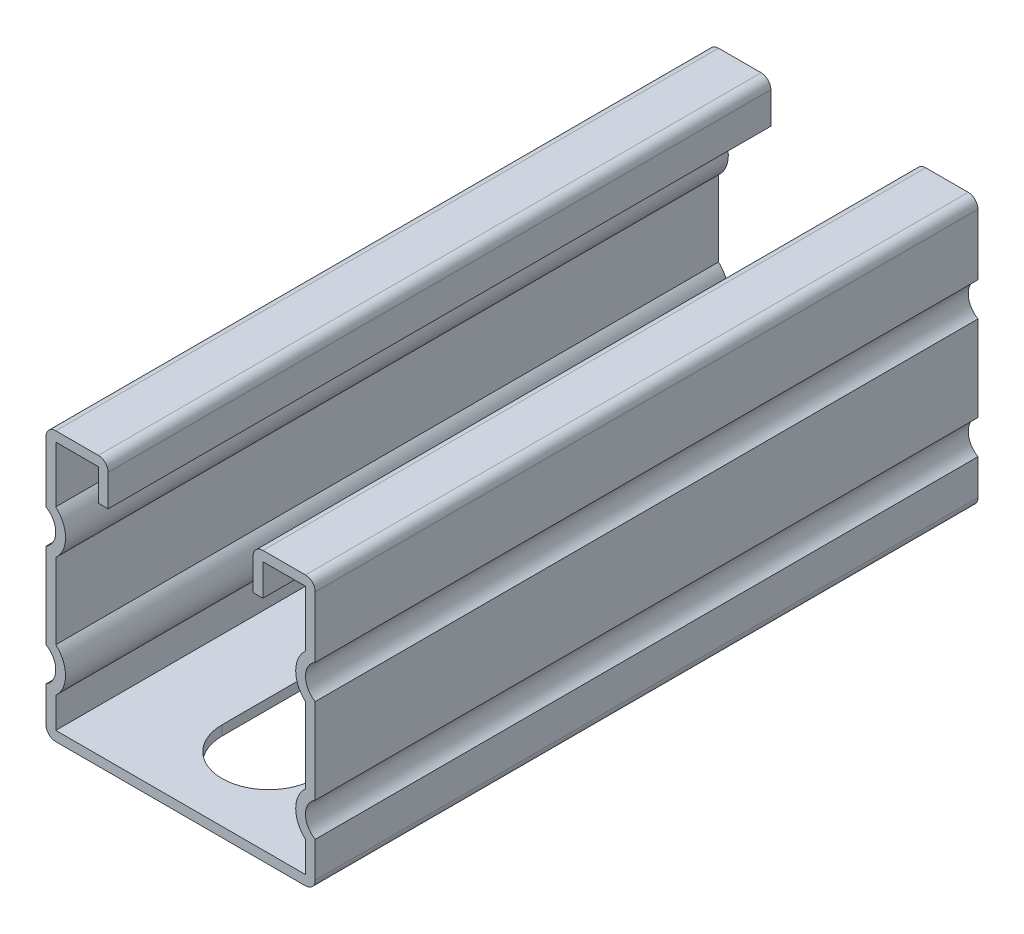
ISO-10303-21;
HEADER;
FILE_DESCRIPTION(('STEP AP214'),'2;1');
FILE_NAME('part.step','',(''),(''),'','','');
FILE_SCHEMA(('AUTOMOTIVE_DESIGN { 1 0 10303 214 1 1 1 1 }'));
ENDSEC;
DATA;
#1=APPLICATION_CONTEXT('core data for automotive mechanical design processes');
#2=APPLICATION_PROTOCOL_DEFINITION('international standard','automotive_design',2000,#1);
#3=PRODUCT_CONTEXT('',#1,'mechanical');
#4=PRODUCT('Part','Part','',(#3));
#5=PRODUCT_RELATED_PRODUCT_CATEGORY('part','',(#4));
#6=PRODUCT_DEFINITION_FORMATION('','',#4);
#7=PRODUCT_DEFINITION_CONTEXT('part definition',#1,'design');
#8=PRODUCT_DEFINITION('design','',#6,#7);
#9=PRODUCT_DEFINITION_SHAPE('','',#8);
#10=(LENGTH_UNIT() NAMED_UNIT(*) SI_UNIT(.MILLI.,.METRE.));
#11=(NAMED_UNIT(*) PLANE_ANGLE_UNIT() SI_UNIT($,.RADIAN.));
#12=(NAMED_UNIT(*) SI_UNIT($,.STERADIAN.) SOLID_ANGLE_UNIT());
#13=UNCERTAINTY_MEASURE_WITH_UNIT(LENGTH_MEASURE(1.E-05),#10,'distance_accuracy_value','');
#14=(GEOMETRIC_REPRESENTATION_CONTEXT(3) GLOBAL_UNCERTAINTY_ASSIGNED_CONTEXT((#13)) GLOBAL_UNIT_ASSIGNED_CONTEXT((#10,
#11,#12)) REPRESENTATION_CONTEXT('',''));
#15=CARTESIAN_POINT('',(0.,0.,0.));
#16=DIRECTION('',(0.,0.,1.));
#17=DIRECTION('',(1.,0.,0.));
#18=AXIS2_PLACEMENT_3D('',#15,#16,#17);
#19=CARTESIAN_POINT('',(-19.1389,21.1074,101.6));
#20=DIRECTION('',(-1.,0.,0.));
#21=DIRECTION('',(0.,-1.,0.));
#22=AXIS2_PLACEMENT_3D('',#19,#20,#21);
#23=PLANE('',#22);
#24=DIRECTION('',(0.,1.,0.));
#25=VECTOR('',#24,1.);
#26=CARTESIAN_POINT('',(-19.1389,21.1074,0.));
#27=LINE('',#26,#25);
#28=CARTESIAN_POINT('',(-19.1389,12.4949714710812,0.));
#29=VERTEX_POINT('',#28);
#30=CARTESIAN_POINT('',(-19.1389,21.1074,0.));
#31=VERTEX_POINT('',#30);
#32=EDGE_CURVE('E373',#29,#31,#27,.T.);
#33=ORIENTED_EDGE('',*,*,#32,.T.);
#34=DIRECTION('',(0.,0.,-1.));
#35=VECTOR('',#34,1.);
#36=CARTESIAN_POINT('',(-19.1389,21.1074,101.6));
#37=LINE('',#36,#35);
#38=CARTESIAN_POINT('',(-19.1389,21.1074,101.6));
#39=VERTEX_POINT('',#38);
#40=EDGE_CURVE('E644',#39,#31,#37,.T.);
#41=ORIENTED_EDGE('',*,*,#40,.F.);
#42=DIRECTION('',(0.,1.,0.));
#43=VECTOR('',#42,1.);
#44=CARTESIAN_POINT('',(-19.1389,21.1074,101.6));
#45=LINE('',#44,#43);
#46=CARTESIAN_POINT('',(-19.1389,12.4949714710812,101.6));
#47=VERTEX_POINT('',#46);
#48=EDGE_CURVE('E380',#47,#39,#45,.T.);
#49=ORIENTED_EDGE('',*,*,#48,.F.);
#50=DIRECTION('',(0.,0.,-1.));
#51=VECTOR('',#50,1.);
#52=CARTESIAN_POINT('',(-19.1389,12.4949714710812,101.6));
#53=LINE('',#52,#51);
#54=EDGE_CURVE('E458',#47,#29,#53,.T.);
#55=ORIENTED_EDGE('',*,*,#54,.T.);
#56=EDGE_LOOP('',(#33,#41,#49,#55));
#57=FACE_BOUND('',#56,.T.);
#58=ADVANCED_FACE('F32',(#57),#23,.F.);
#59=CARTESIAN_POINT('',(-19.1389,21.1074,101.6));
#60=DIRECTION('',(0.,1.,0.));
#61=DIRECTION('',(-1.,0.,0.));
#62=AXIS2_PLACEMENT_3D('',#59,#60,#61);
#63=PLANE('',#62);
#64=DIRECTION('',(1.,0.,0.));
#65=VECTOR('',#64,1.);
#66=CARTESIAN_POINT('',(-19.1389,21.1074,0.));
#67=LINE('',#66,#65);
#68=CARTESIAN_POINT('',(-12.6111,21.1074,0.));
#69=VERTEX_POINT('',#68);
#70=EDGE_CURVE('E461',#31,#69,#67,.T.);
#71=ORIENTED_EDGE('',*,*,#70,.T.);
#72=DIRECTION('',(0.,0.,-1.));
#73=VECTOR('',#72,1.);
#74=CARTESIAN_POINT('',(-12.6111,21.1074,101.6));
#75=LINE('',#74,#73);
#76=CARTESIAN_POINT('',(-12.6111,21.1074,101.6));
#77=VERTEX_POINT('',#76);
#78=EDGE_CURVE('E641',#77,#69,#75,.T.);
#79=ORIENTED_EDGE('',*,*,#78,.F.);
#80=DIRECTION('',(1.,0.,0.));
#81=VECTOR('',#80,1.);
#82=CARTESIAN_POINT('',(-19.1389,21.1074,101.6));
#83=LINE('',#82,#81);
#84=EDGE_CURVE('E383',#39,#77,#83,.T.);
#85=ORIENTED_EDGE('',*,*,#84,.F.);
#86=ORIENTED_EDGE('',*,*,#40,.T.);
#87=EDGE_LOOP('',(#71,#79,#85,#86));
#88=FACE_BOUND('',#87,.T.);
#89=ADVANCED_FACE('F685',(#88),#63,.F.);
#90=CARTESIAN_POINT('',(-12.6111,21.1074,101.6));
#91=DIRECTION('',(1.,0.,0.));
#92=DIRECTION('',(0.,0.,-1.));
#93=AXIS2_PLACEMENT_3D('',#90,#91,#92);
#94=PLANE('',#93);
#95=DIRECTION('',(0.,-1.,0.));
#96=VECTOR('',#95,1.);
#97=CARTESIAN_POINT('',(-12.6111,21.1074,0.));
#98=LINE('',#97,#96);
#99=CARTESIAN_POINT('',(-12.6111,16.256,0.));
#100=VERTEX_POINT('',#99);
#101=EDGE_CURVE('E463',#69,#100,#98,.T.);
#102=ORIENTED_EDGE('',*,*,#101,.T.);
#103=DIRECTION('',(0.,0.,-1.));
#104=VECTOR('',#103,1.);
#105=CARTESIAN_POINT('',(-12.6111,16.256,101.6));
#106=LINE('',#105,#104);
#107=CARTESIAN_POINT('',(-12.6111,16.256,101.6));
#108=VERTEX_POINT('',#107);
#109=EDGE_CURVE('E638',#108,#100,#106,.T.);
#110=ORIENTED_EDGE('',*,*,#109,.F.);
#111=DIRECTION('',(0.,-1.,0.));
#112=VECTOR('',#111,1.);
#113=CARTESIAN_POINT('',(-12.6111,21.1074,101.6));
#114=LINE('',#113,#112);
#115=EDGE_CURVE('E386',#77,#108,#114,.T.);
#116=ORIENTED_EDGE('',*,*,#115,.F.);
#117=ORIENTED_EDGE('',*,*,#78,.T.);
#118=EDGE_LOOP('',(#102,#110,#116,#117));
#119=FACE_BOUND('',#118,.T.);
#120=ADVANCED_FACE('F690',(#119),#94,.F.);
#121=CARTESIAN_POINT('',(-12.6111,16.256,101.6));
#122=DIRECTION('',(0.,1.,0.));
#123=DIRECTION('',(0.,0.,1.));
#124=AXIS2_PLACEMENT_3D('',#121,#122,#123);
#125=PLANE('',#124);
#126=DIRECTION('',(1.,0.,0.));
#127=VECTOR('',#126,1.);
#128=CARTESIAN_POINT('',(-12.6111,16.256,0.));
#129=LINE('',#128,#127);
#130=CARTESIAN_POINT('',(-11.1125,16.256,0.));
#131=VERTEX_POINT('',#130);
#132=EDGE_CURVE('E465',#100,#131,#129,.T.);
#133=ORIENTED_EDGE('',*,*,#132,.T.);
#134=DIRECTION('',(0.,0.,-1.));
#135=VECTOR('',#134,1.);
#136=CARTESIAN_POINT('',(-11.1125,16.256,101.6));
#137=LINE('',#136,#135);
#138=CARTESIAN_POINT('',(-11.1125,16.256,101.6));
#139=VERTEX_POINT('',#138);
#140=EDGE_CURVE('E635',#139,#131,#137,.T.);
#141=ORIENTED_EDGE('',*,*,#140,.F.);
#142=DIRECTION('',(1.,0.,0.));
#143=VECTOR('',#142,1.);
#144=CARTESIAN_POINT('',(-12.6111,16.256,101.6));
#145=LINE('',#144,#143);
#146=EDGE_CURVE('E388',#108,#139,#145,.T.);
#147=ORIENTED_EDGE('',*,*,#146,.F.);
#148=ORIENTED_EDGE('',*,*,#109,.T.);
#149=EDGE_LOOP('',(#133,#141,#147,#148));
#150=FACE_BOUND('',#149,.T.);
#151=ADVANCED_FACE('F872',(#150),#125,.F.);
#152=CARTESIAN_POINT('',(-11.1125,21.1074,101.6));
#153=DIRECTION('',(-1.,0.,0.));
#154=DIRECTION('',(0.,-1.,0.));
#155=AXIS2_PLACEMENT_3D('',#152,#153,#154);
#156=PLANE('',#155);
#157=DIRECTION('',(0.,1.,0.));
#158=VECTOR('',#157,1.);
#159=CARTESIAN_POINT('',(-11.1125,21.1074,0.));
#160=LINE('',#159,#158);
#161=CARTESIAN_POINT('',(-11.1125,21.1074,0.));
#162=VERTEX_POINT('',#161);
#163=EDGE_CURVE('E467',#131,#162,#160,.T.);
#164=ORIENTED_EDGE('',*,*,#163,.T.);
#165=DIRECTION('',(0.,0.,-1.));
#166=VECTOR('',#165,1.);
#167=CARTESIAN_POINT('',(-11.1125,21.1074,101.6));
#168=LINE('',#167,#166);
#169=CARTESIAN_POINT('',(-11.1125,21.1074,101.6));
#170=VERTEX_POINT('',#169);
#171=EDGE_CURVE('E632',#170,#162,#168,.T.);
#172=ORIENTED_EDGE('',*,*,#171,.F.);
#173=DIRECTION('',(0.,1.,0.));
#174=VECTOR('',#173,1.);
#175=CARTESIAN_POINT('',(-11.1125,21.1074,101.6));
#176=LINE('',#175,#174);
#177=EDGE_CURVE('E390',#139,#170,#176,.T.);
#178=ORIENTED_EDGE('',*,*,#177,.F.);
#179=ORIENTED_EDGE('',*,*,#140,.T.);
#180=EDGE_LOOP('',(#164,#172,#178,#179));
#181=FACE_BOUND('',#180,.T.);
#182=ADVANCED_FACE('F868',(#181),#156,.F.);
#183=CARTESIAN_POINT('',(-12.6111,21.1074,101.6));
#184=DIRECTION('',(0.,0.,-1.));
#185=DIRECTION('',(-1.,0.,0.));
#186=AXIS2_PLACEMENT_3D('',#183,#184,#185);
#187=CYLINDRICAL_SURFACE('',#186,1.4986);
#188=CARTESIAN_POINT('',(-12.6111,21.1074,0.));
#189=DIRECTION('',(0.,0.,1.));
#190=DIRECTION('',(-1.,0.,0.));
#191=AXIS2_PLACEMENT_3D('',#188,#189,#190);
#192=CIRCLE('',#191,1.4986);
#193=CARTESIAN_POINT('',(-12.6111,22.606,0.));
#194=VERTEX_POINT('',#193);
#195=EDGE_CURVE('E469',#162,#194,#192,.T.);
#196=ORIENTED_EDGE('',*,*,#195,.T.);
#197=DIRECTION('',(0.,0.,-1.));
#198=VECTOR('',#197,1.);
#199=CARTESIAN_POINT('',(-12.6111,22.606,101.6));
#200=LINE('',#199,#198);
#201=CARTESIAN_POINT('',(-12.6111,22.606,101.6));
#202=VERTEX_POINT('',#201);
#203=EDGE_CURVE('E629',#202,#194,#200,.T.);
#204=ORIENTED_EDGE('',*,*,#203,.F.);
#205=CARTESIAN_POINT('',(-12.6111,21.1074,101.6));
#206=DIRECTION('',(0.,0.,1.));
#207=DIRECTION('',(-1.,0.,0.));
#208=AXIS2_PLACEMENT_3D('',#205,#206,#207);
#209=CIRCLE('',#208,1.4986);
#210=EDGE_CURVE('E392',#170,#202,#209,.T.);
#211=ORIENTED_EDGE('',*,*,#210,.F.);
#212=ORIENTED_EDGE('',*,*,#171,.T.);
#213=EDGE_LOOP('',(#196,#204,#211,#212));
#214=FACE_BOUND('',#213,.T.);
#215=ADVANCED_FACE('F863',(#214),#187,.T.);
#216=CARTESIAN_POINT('',(-19.1389,22.606,101.6));
#217=DIRECTION('',(0.,-1.,0.));
#218=DIRECTION('',(1.,0.,0.));
#219=AXIS2_PLACEMENT_3D('',#216,#217,#218);
#220=PLANE('',#219);
#221=DIRECTION('',(-1.,0.,0.));
#222=VECTOR('',#221,1.);
#223=CARTESIAN_POINT('',(-19.1389,22.606,0.));
#224=LINE('',#223,#222);
#225=CARTESIAN_POINT('',(-19.1389,22.606,0.));
#226=VERTEX_POINT('',#225);
#227=EDGE_CURVE('E471',#194,#226,#224,.T.);
#228=ORIENTED_EDGE('',*,*,#227,.T.);
#229=DIRECTION('',(0.,0.,-1.));
#230=VECTOR('',#229,1.);
#231=CARTESIAN_POINT('',(-19.1389,22.606,101.6));
#232=LINE('',#231,#230);
#233=CARTESIAN_POINT('',(-19.1389,22.606,101.6));
#234=VERTEX_POINT('',#233);
#235=EDGE_CURVE('E626',#234,#226,#232,.T.);
#236=ORIENTED_EDGE('',*,*,#235,.F.);
#237=DIRECTION('',(-1.,0.,0.));
#238=VECTOR('',#237,1.);
#239=CARTESIAN_POINT('',(-19.1389,22.606,101.6));
#240=LINE('',#239,#238);
#241=EDGE_CURVE('E394',#202,#234,#240,.T.);
#242=ORIENTED_EDGE('',*,*,#241,.F.);
#243=ORIENTED_EDGE('',*,*,#203,.T.);
#244=EDGE_LOOP('',(#228,#236,#242,#243));
#245=FACE_BOUND('',#244,.T.);
#246=ADVANCED_FACE('F858',(#245),#220,.F.);
#247=CARTESIAN_POINT('',(-19.1389,21.1074,101.6));
#248=DIRECTION('',(0.,0.,-1.));
#249=DIRECTION('',(-1.,0.,0.));
#250=AXIS2_PLACEMENT_3D('',#247,#248,#249);
#251=CYLINDRICAL_SURFACE('',#250,1.49860000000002);
#252=CARTESIAN_POINT('',(-19.1389,21.1074,0.));
#253=DIRECTION('',(0.,0.,1.));
#254=DIRECTION('',(-1.,0.,0.));
#255=AXIS2_PLACEMENT_3D('',#252,#253,#254);
#256=CIRCLE('',#255,1.49860000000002);
#257=CARTESIAN_POINT('',(-20.6375,21.1074,0.));
#258=VERTEX_POINT('',#257);
#259=EDGE_CURVE('E473',#226,#258,#256,.T.);
#260=ORIENTED_EDGE('',*,*,#259,.T.);
#261=DIRECTION('',(0.,0.,-1.));
#262=VECTOR('',#261,1.);
#263=CARTESIAN_POINT('',(-20.6375,21.1074,101.6));
#264=LINE('',#263,#262);
#265=CARTESIAN_POINT('',(-20.6375,21.1074,101.6));
#266=VERTEX_POINT('',#265);
#267=EDGE_CURVE('E623',#266,#258,#264,.T.);
#268=ORIENTED_EDGE('',*,*,#267,.F.);
#269=CARTESIAN_POINT('',(-19.1389,21.1074,101.6));
#270=DIRECTION('',(0.,0.,1.));
#271=DIRECTION('',(-1.,0.,0.));
#272=AXIS2_PLACEMENT_3D('',#269,#270,#271);
#273=CIRCLE('',#272,1.49860000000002);
#274=EDGE_CURVE('E396',#234,#266,#273,.T.);
#275=ORIENTED_EDGE('',*,*,#274,.F.);
#276=ORIENTED_EDGE('',*,*,#235,.T.);
#277=EDGE_LOOP('',(#260,#268,#275,#276));
#278=FACE_BOUND('',#277,.T.);
#279=ADVANCED_FACE('F854',(#278),#251,.T.);
#280=CARTESIAN_POINT('',(-20.6375,21.1074,101.6));
#281=DIRECTION('',(1.,0.,0.));
#282=DIRECTION('',(0.,0.,-1.));
#283=AXIS2_PLACEMENT_3D('',#280,#281,#282);
#284=PLANE('',#283);
#285=DIRECTION('',(0.,-1.,0.));
#286=VECTOR('',#285,1.);
#287=CARTESIAN_POINT('',(-20.6375,21.1074,0.));
#288=LINE('',#287,#286);
#289=CARTESIAN_POINT('',(-20.6375,11.7396513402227,0.));
#290=VERTEX_POINT('',#289);
#291=EDGE_CURVE('E475',#258,#290,#288,.T.);
#292=ORIENTED_EDGE('',*,*,#291,.T.);
#293=DIRECTION('',(0.,0.,-1.));
#294=VECTOR('',#293,1.);
#295=CARTESIAN_POINT('',(-20.6375,11.7396513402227,101.6));
#296=LINE('',#295,#294);
#297=CARTESIAN_POINT('',(-20.6375,11.7396513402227,101.6));
#298=VERTEX_POINT('',#297);
#299=EDGE_CURVE('E620',#298,#290,#296,.T.);
#300=ORIENTED_EDGE('',*,*,#299,.F.);
#301=DIRECTION('',(0.,-1.,0.));
#302=VECTOR('',#301,1.);
#303=CARTESIAN_POINT('',(-20.6375,21.1074,101.6));
#304=LINE('',#303,#302);
#305=EDGE_CURVE('E398',#266,#298,#304,.T.);
#306=ORIENTED_EDGE('',*,*,#305,.F.);
#307=ORIENTED_EDGE('',*,*,#267,.T.);
#308=EDGE_LOOP('',(#292,#300,#306,#307));
#309=FACE_BOUND('',#308,.T.);
#310=ADVANCED_FACE('F849',(#309),#284,.F.);
#311=CARTESIAN_POINT('',(-22.1361,9.144,101.6));
#312=DIRECTION('',(0.,0.,-1.));
#313=DIRECTION('',(-1.,0.,0.));
#314=AXIS2_PLACEMENT_3D('',#311,#312,#313);
#315=CYLINDRICAL_SURFACE('',#314,2.9972);
#316=CARTESIAN_POINT('',(-22.1361,9.144,0.));
#317=DIRECTION('',(0.,0.,-1.));
#318=DIRECTION('',(1.,0.,0.));
#319=AXIS2_PLACEMENT_3D('',#316,#317,#318);
#320=CIRCLE('',#319,2.9972);
#321=CARTESIAN_POINT('',(-20.6375,6.54834865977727,0.));
#322=VERTEX_POINT('',#321);
#323=EDGE_CURVE('E477',#290,#322,#320,.T.);
#324=ORIENTED_EDGE('',*,*,#323,.T.);
#325=DIRECTION('',(0.,0.,-1.));
#326=VECTOR('',#325,1.);
#327=CARTESIAN_POINT('',(-20.6375,6.54834865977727,101.6));
#328=LINE('',#327,#326);
#329=CARTESIAN_POINT('',(-20.6375,6.54834865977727,101.6));
#330=VERTEX_POINT('',#329);
#331=EDGE_CURVE('E617',#330,#322,#328,.T.);
#332=ORIENTED_EDGE('',*,*,#331,.F.);
#333=CARTESIAN_POINT('',(-22.1361,9.144,101.6));
#334=DIRECTION('',(0.,0.,-1.));
#335=DIRECTION('',(1.,0.,0.));
#336=AXIS2_PLACEMENT_3D('',#333,#334,#335);
#337=CIRCLE('',#336,2.9972);
#338=EDGE_CURVE('E400',#298,#330,#337,.T.);
#339=ORIENTED_EDGE('',*,*,#338,.F.);
#340=ORIENTED_EDGE('',*,*,#299,.T.);
#341=EDGE_LOOP('',(#324,#332,#339,#340));
#342=FACE_BOUND('',#341,.T.);
#343=ADVANCED_FACE('F843',(#342),#315,.F.);
#344=CARTESIAN_POINT('',(-20.6375,6.54834865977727,101.6));
#345=DIRECTION('',(1.,0.,0.));
#346=DIRECTION('',(0.,0.,-1.));
#347=AXIS2_PLACEMENT_3D('',#344,#345,#346);
#348=PLANE('',#347);
#349=DIRECTION('',(0.,-1.,0.));
#350=VECTOR('',#349,1.);
#351=CARTESIAN_POINT('',(-20.6375,6.54834865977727,0.));
#352=LINE('',#351,#350);
#353=CARTESIAN_POINT('',(-20.6375,-6.54834865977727,0.));
#354=VERTEX_POINT('',#353);
#355=EDGE_CURVE('E479',#322,#354,#352,.T.);
#356=ORIENTED_EDGE('',*,*,#355,.T.);
#357=DIRECTION('',(0.,0.,-1.));
#358=VECTOR('',#357,1.);
#359=CARTESIAN_POINT('',(-20.6375,-6.54834865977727,101.6));
#360=LINE('',#359,#358);
#361=CARTESIAN_POINT('',(-20.6375,-6.54834865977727,101.6));
#362=VERTEX_POINT('',#361);
#363=EDGE_CURVE('E614',#362,#354,#360,.T.);
#364=ORIENTED_EDGE('',*,*,#363,.F.);
#365=DIRECTION('',(0.,-1.,0.));
#366=VECTOR('',#365,1.);
#367=CARTESIAN_POINT('',(-20.6375,6.54834865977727,101.6));
#368=LINE('',#367,#366);
#369=EDGE_CURVE('E402',#330,#362,#368,.T.);
#370=ORIENTED_EDGE('',*,*,#369,.F.);
#371=ORIENTED_EDGE('',*,*,#331,.T.);
#372=EDGE_LOOP('',(#356,#364,#370,#371));
#373=FACE_BOUND('',#372,.T.);
#374=ADVANCED_FACE('F839',(#373),#348,.F.);
#375=CARTESIAN_POINT('',(-22.1361,-9.144,101.6));
#376=DIRECTION('',(0.,0.,-1.));
#377=DIRECTION('',(-1.,0.,0.));
#378=AXIS2_PLACEMENT_3D('',#375,#376,#377);
#379=CYLINDRICAL_SURFACE('',#378,2.9972);
#380=CARTESIAN_POINT('',(-22.1361,-9.144,0.));
#381=DIRECTION('',(0.,0.,-1.));
#382=DIRECTION('',(-1.,0.,0.));
#383=AXIS2_PLACEMENT_3D('',#380,#381,#382);
#384=CIRCLE('',#383,2.9972);
#385=CARTESIAN_POINT('',(-20.6375,-11.7396513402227,0.));
#386=VERTEX_POINT('',#385);
#387=EDGE_CURVE('E481',#354,#386,#384,.T.);
#388=ORIENTED_EDGE('',*,*,#387,.T.);
#389=DIRECTION('',(0.,0.,-1.));
#390=VECTOR('',#389,1.);
#391=CARTESIAN_POINT('',(-20.6375,-11.7396513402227,101.6));
#392=LINE('',#391,#390);
#393=CARTESIAN_POINT('',(-20.6375,-11.7396513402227,101.6));
#394=VERTEX_POINT('',#393);
#395=EDGE_CURVE('E611',#394,#386,#392,.T.);
#396=ORIENTED_EDGE('',*,*,#395,.F.);
#397=CARTESIAN_POINT('',(-22.1361,-9.144,101.6));
#398=DIRECTION('',(0.,0.,-1.));
#399=DIRECTION('',(-1.,0.,0.));
#400=AXIS2_PLACEMENT_3D('',#397,#398,#399);
#401=CIRCLE('',#400,2.9972);
#402=EDGE_CURVE('E404',#362,#394,#401,.T.);
#403=ORIENTED_EDGE('',*,*,#402,.F.);
#404=ORIENTED_EDGE('',*,*,#363,.T.);
#405=EDGE_LOOP('',(#388,#396,#403,#404));
#406=FACE_BOUND('',#405,.T.);
#407=ADVANCED_FACE('F834',(#406),#379,.F.);
#408=CARTESIAN_POINT('',(-20.6375,-11.7396513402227,101.6));
#409=DIRECTION('',(1.,0.,0.));
#410=DIRECTION('',(0.,1.,0.));
#411=AXIS2_PLACEMENT_3D('',#408,#409,#410);
#412=PLANE('',#411);
#413=DIRECTION('',(0.,-1.,0.));
#414=VECTOR('',#413,1.);
#415=CARTESIAN_POINT('',(-20.6375,-11.7396513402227,0.));
#416=LINE('',#415,#414);
#417=CARTESIAN_POINT('',(-20.6375,-17.1704,0.));
#418=VERTEX_POINT('',#417);
#419=EDGE_CURVE('E483',#386,#418,#416,.T.);
#420=ORIENTED_EDGE('',*,*,#419,.T.);
#421=DIRECTION('',(0.,0.,-1.));
#422=VECTOR('',#421,1.);
#423=CARTESIAN_POINT('',(-20.6375,-17.1704,101.6));
#424=LINE('',#423,#422);
#425=CARTESIAN_POINT('',(-20.6375,-17.1704,101.6));
#426=VERTEX_POINT('',#425);
#427=EDGE_CURVE('E608',#426,#418,#424,.T.);
#428=ORIENTED_EDGE('',*,*,#427,.F.);
#429=DIRECTION('',(0.,-1.,0.));
#430=VECTOR('',#429,1.);
#431=CARTESIAN_POINT('',(-20.6375,-11.7396513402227,101.6));
#432=LINE('',#431,#430);
#433=EDGE_CURVE('E406',#394,#426,#432,.T.);
#434=ORIENTED_EDGE('',*,*,#433,.F.);
#435=ORIENTED_EDGE('',*,*,#395,.T.);
#436=EDGE_LOOP('',(#420,#428,#434,#435));
#437=FACE_BOUND('',#436,.T.);
#438=ADVANCED_FACE('F828',(#437),#412,.F.);
#439=CARTESIAN_POINT('',(-19.1389,-17.1704,101.6));
#440=DIRECTION('',(0.,0.,-1.));
#441=DIRECTION('',(-1.,0.,0.));
#442=AXIS2_PLACEMENT_3D('',#439,#440,#441);
#443=CYLINDRICAL_SURFACE('',#442,1.4986);
#444=CARTESIAN_POINT('',(-19.1389,-17.1704,0.));
#445=DIRECTION('',(0.,0.,1.));
#446=DIRECTION('',(-1.,0.,0.));
#447=AXIS2_PLACEMENT_3D('',#444,#445,#446);
#448=CIRCLE('',#447,1.4986);
#449=CARTESIAN_POINT('',(-19.1389,-18.669,0.));
#450=VERTEX_POINT('',#449);
#451=EDGE_CURVE('E485',#418,#450,#448,.T.);
#452=ORIENTED_EDGE('',*,*,#451,.T.);
#453=DIRECTION('',(0.,0.,-1.));
#454=VECTOR('',#453,1.);
#455=CARTESIAN_POINT('',(-19.1389,-18.669,101.6));
#456=LINE('',#455,#454);
#457=CARTESIAN_POINT('',(-19.1389,-18.669,101.6));
#458=VERTEX_POINT('',#457);
#459=EDGE_CURVE('E605',#458,#450,#456,.T.);
#460=ORIENTED_EDGE('',*,*,#459,.F.);
#461=CARTESIAN_POINT('',(-19.1389,-17.1704,101.6));
#462=DIRECTION('',(0.,0.,1.));
#463=DIRECTION('',(-1.,0.,0.));
#464=AXIS2_PLACEMENT_3D('',#461,#462,#463);
#465=CIRCLE('',#464,1.4986);
#466=EDGE_CURVE('E408',#426,#458,#465,.T.);
#467=ORIENTED_EDGE('',*,*,#466,.F.);
#468=ORIENTED_EDGE('',*,*,#427,.T.);
#469=EDGE_LOOP('',(#452,#460,#467,#468));
#470=FACE_BOUND('',#469,.T.);
#471=ADVANCED_FACE('F824',(#470),#443,.T.);
#472=CARTESIAN_POINT('',(-19.1389,-18.669,101.6));
#473=DIRECTION('',(0.,1.,0.));
#474=DIRECTION('',(0.,0.,1.));
#475=AXIS2_PLACEMENT_3D('',#472,#473,#474);
#476=PLANE('',#475);
#477=DIRECTION('',(0.,0.,-1.));
#478=VECTOR('',#477,1.);
#479=CARTESIAN_POINT('',(-7.14375,-18.6689999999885,73.81875));
#480=LINE('',#479,#478);
#481=CARTESIAN_POINT('',(-7.14375,-18.669,88.10625));
#482=VERTEX_POINT('',#481);
#483=CARTESIAN_POINT('',(-7.14375,-18.6689999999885,73.81875));
#484=VERTEX_POINT('',#483);
#485=EDGE_CURVE('E326',#482,#484,#480,.T.);
#486=ORIENTED_EDGE('',*,*,#485,.F.);
#487=CARTESIAN_POINT('',(0.,-18.6689999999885,88.10625));
#488=DIRECTION('',(0.,-1.,0.));
#489=DIRECTION('',(0.,0.,-1.));
#490=AXIS2_PLACEMENT_3D('',#487,#488,#489);
#491=CIRCLE('',#490,7.14375);
#492=CARTESIAN_POINT('',(7.14375,-18.6689999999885,88.10625));
#493=VERTEX_POINT('',#492);
#494=EDGE_CURVE('E46',#493,#482,#491,.T.);
#495=ORIENTED_EDGE('',*,*,#494,.F.);
#496=DIRECTION('',(0.,0.,1.));
#497=VECTOR('',#496,1.);
#498=CARTESIAN_POINT('',(7.14375,-18.6689999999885,88.10625));
#499=LINE('',#498,#497);
#500=CARTESIAN_POINT('',(7.14375,-18.6689999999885,73.81875));
#501=VERTEX_POINT('',#500);
#502=EDGE_CURVE('E342',#501,#493,#499,.T.);
#503=ORIENTED_EDGE('',*,*,#502,.F.);
#504=CARTESIAN_POINT('',(0.,-18.6689999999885,73.81875));
#505=DIRECTION('',(0.,-1.,0.));
#506=DIRECTION('',(0.,0.,-1.));
#507=AXIS2_PLACEMENT_3D('',#504,#505,#506);
#508=CIRCLE('',#507,7.14375);
#509=EDGE_CURVE('E336',#484,#501,#508,.T.);
#510=ORIENTED_EDGE('',*,*,#509,.F.);
#511=EDGE_LOOP('',(#486,#495,#503,#510));
#512=FACE_BOUND('',#511,.T.);
#513=DIRECTION('',(0.,0.,-1.));
#514=VECTOR('',#513,1.);
#515=CARTESIAN_POINT('',(-7.14375,-18.6689999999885,23.01875));
#516=LINE('',#515,#514);
#517=CARTESIAN_POINT('',(-7.14375,-18.669,37.30625));
#518=VERTEX_POINT('',#517);
#519=CARTESIAN_POINT('',(-7.14375,-18.6689999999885,23.01875));
#520=VERTEX_POINT('',#519);
#521=EDGE_CURVE('E361',#518,#520,#516,.T.);
#522=ORIENTED_EDGE('',*,*,#521,.F.);
#523=CARTESIAN_POINT('',(0.,-18.6689999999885,37.30625));
#524=DIRECTION('',(0.,-1.,0.));
#525=DIRECTION('',(0.,0.,-1.));
#526=AXIS2_PLACEMENT_3D('',#523,#524,#525);
#527=CIRCLE('',#526,7.14375);
#528=CARTESIAN_POINT('',(7.14375,-18.6689999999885,37.30625));
#529=VERTEX_POINT('',#528);
#530=EDGE_CURVE('E359',#529,#518,#527,.T.);
#531=ORIENTED_EDGE('',*,*,#530,.F.);
#532=DIRECTION('',(0.,0.,1.));
#533=VECTOR('',#532,1.);
#534=CARTESIAN_POINT('',(7.14375,-18.6689999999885,37.30625));
#535=LINE('',#534,#533);
#536=CARTESIAN_POINT('',(7.14375,-18.6689999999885,23.01875));
#537=VERTEX_POINT('',#536);
#538=EDGE_CURVE('E367',#537,#529,#535,.T.);
#539=ORIENTED_EDGE('',*,*,#538,.F.);
#540=CARTESIAN_POINT('',(0.,-18.6689999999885,23.01875));
#541=DIRECTION('',(0.,-1.,0.));
#542=DIRECTION('',(0.,0.,-1.));
#543=AXIS2_PLACEMENT_3D('',#540,#541,#542);
#544=CIRCLE('',#543,7.14375);
#545=EDGE_CURVE('E364',#520,#537,#544,.T.);
#546=ORIENTED_EDGE('',*,*,#545,.F.);
#547=EDGE_LOOP('',(#522,#531,#539,#546));
#548=FACE_BOUND('',#547,.T.);
#549=DIRECTION('',(1.,0.,0.));
#550=VECTOR('',#549,1.);
#551=CARTESIAN_POINT('',(-19.1389,-18.669,0.));
#552=LINE('',#551,#550);
#553=CARTESIAN_POINT('',(19.1389,-18.669,0.));
#554=VERTEX_POINT('',#553);
#555=EDGE_CURVE('E487',#450,#554,#552,.T.);
#556=ORIENTED_EDGE('',*,*,#555,.T.);
#557=DIRECTION('',(0.,0.,-1.));
#558=VECTOR('',#557,1.);
#559=CARTESIAN_POINT('',(19.1389,-18.669,101.6));
#560=LINE('',#559,#558);
#561=CARTESIAN_POINT('',(19.1389,-18.669,101.6));
#562=VERTEX_POINT('',#561);
#563=EDGE_CURVE('E602',#562,#554,#560,.T.);
#564=ORIENTED_EDGE('',*,*,#563,.F.);
#565=DIRECTION('',(1.,0.,0.));
#566=VECTOR('',#565,1.);
#567=CARTESIAN_POINT('',(-19.1389,-18.669,101.6));
#568=LINE('',#567,#566);
#569=EDGE_CURVE('E410',#458,#562,#568,.T.);
#570=ORIENTED_EDGE('',*,*,#569,.F.);
#571=ORIENTED_EDGE('',*,*,#459,.T.);
#572=EDGE_LOOP('',(#556,#564,#570,#571));
#573=FACE_BOUND('',#572,.T.);
#574=ADVANCED_FACE('F340',(#512,#548,#573),#476,.F.);
#575=CARTESIAN_POINT('',(19.1389,-17.1704,101.6));
#576=DIRECTION('',(0.,0.,-1.));
#577=DIRECTION('',(-1.,0.,0.));
#578=AXIS2_PLACEMENT_3D('',#575,#576,#577);
#579=CYLINDRICAL_SURFACE('',#578,1.4986);
#580=CARTESIAN_POINT('',(19.1389,-17.1704,0.));
#581=DIRECTION('',(0.,0.,1.));
#582=DIRECTION('',(-1.,0.,0.));
#583=AXIS2_PLACEMENT_3D('',#580,#581,#582);
#584=CIRCLE('',#583,1.4986);
#585=CARTESIAN_POINT('',(20.6375,-17.1704,0.));
#586=VERTEX_POINT('',#585);
#587=EDGE_CURVE('E489',#554,#586,#584,.T.);
#588=ORIENTED_EDGE('',*,*,#587,.T.);
#589=DIRECTION('',(0.,0.,-1.));
#590=VECTOR('',#589,1.);
#591=CARTESIAN_POINT('',(20.6375,-17.1704,101.6));
#592=LINE('',#591,#590);
#593=CARTESIAN_POINT('',(20.6375,-17.1704,101.6));
#594=VERTEX_POINT('',#593);
#595=EDGE_CURVE('E599',#594,#586,#592,.T.);
#596=ORIENTED_EDGE('',*,*,#595,.F.);
#597=CARTESIAN_POINT('',(19.1389,-17.1704,101.6));
#598=DIRECTION('',(0.,0.,1.));
#599=DIRECTION('',(-1.,0.,0.));
#600=AXIS2_PLACEMENT_3D('',#597,#598,#599);
#601=CIRCLE('',#600,1.4986);
#602=EDGE_CURVE('E412',#562,#594,#601,.T.);
#603=ORIENTED_EDGE('',*,*,#602,.F.);
#604=ORIENTED_EDGE('',*,*,#563,.T.);
#605=EDGE_LOOP('',(#588,#596,#603,#604));
#606=FACE_BOUND('',#605,.T.);
#607=ADVANCED_FACE('F815',(#606),#579,.T.);
#608=CARTESIAN_POINT('',(20.6375,-17.1704,101.6));
#609=DIRECTION('',(-1.,0.,0.));
#610=DIRECTION('',(0.,-1.,0.));
#611=AXIS2_PLACEMENT_3D('',#608,#609,#610);
#612=PLANE('',#611);
#613=DIRECTION('',(0.,1.,0.));
#614=VECTOR('',#613,1.);
#615=CARTESIAN_POINT('',(20.6375,-17.1704,0.));
#616=LINE('',#615,#614);
#617=CARTESIAN_POINT('',(20.6375,-11.7396513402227,0.));
#618=VERTEX_POINT('',#617);
#619=EDGE_CURVE('E491',#586,#618,#616,.T.);
#620=ORIENTED_EDGE('',*,*,#619,.T.);
#621=DIRECTION('',(0.,0.,-1.));
#622=VECTOR('',#621,1.);
#623=CARTESIAN_POINT('',(20.6375,-11.7396513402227,101.6));
#624=LINE('',#623,#622);
#625=CARTESIAN_POINT('',(20.6375,-11.7396513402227,101.6));
#626=VERTEX_POINT('',#625);
#627=EDGE_CURVE('E596',#626,#618,#624,.T.);
#628=ORIENTED_EDGE('',*,*,#627,.F.);
#629=DIRECTION('',(0.,1.,0.));
#630=VECTOR('',#629,1.);
#631=CARTESIAN_POINT('',(20.6375,-17.1704,101.6));
#632=LINE('',#631,#630);
#633=EDGE_CURVE('E414',#594,#626,#632,.T.);
#634=ORIENTED_EDGE('',*,*,#633,.F.);
#635=ORIENTED_EDGE('',*,*,#595,.T.);
#636=EDGE_LOOP('',(#620,#628,#634,#635));
#637=FACE_BOUND('',#636,.T.);
#638=ADVANCED_FACE('F811',(#637),#612,.F.);
#639=CARTESIAN_POINT('',(22.1361,-9.144,101.6));
#640=DIRECTION('',(0.,0.,-1.));
#641=DIRECTION('',(-1.,0.,0.));
#642=AXIS2_PLACEMENT_3D('',#639,#640,#641);
#643=CYLINDRICAL_SURFACE('',#642,2.9972);
#644=CARTESIAN_POINT('',(22.1361,-9.144,0.));
#645=DIRECTION('',(0.,0.,-1.));
#646=DIRECTION('',(-1.,0.,0.));
#647=AXIS2_PLACEMENT_3D('',#644,#645,#646);
#648=CIRCLE('',#647,2.9972);
#649=CARTESIAN_POINT('',(20.6375,-6.54834865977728,0.));
#650=VERTEX_POINT('',#649);
#651=EDGE_CURVE('E493',#618,#650,#648,.T.);
#652=ORIENTED_EDGE('',*,*,#651,.T.);
#653=DIRECTION('',(0.,0.,-1.));
#654=VECTOR('',#653,1.);
#655=CARTESIAN_POINT('',(20.6375,-6.54834865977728,101.6));
#656=LINE('',#655,#654);
#657=CARTESIAN_POINT('',(20.6375,-6.54834865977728,101.6));
#658=VERTEX_POINT('',#657);
#659=EDGE_CURVE('E593',#658,#650,#656,.T.);
#660=ORIENTED_EDGE('',*,*,#659,.F.);
#661=CARTESIAN_POINT('',(22.1361,-9.144,101.6));
#662=DIRECTION('',(0.,0.,-1.));
#663=DIRECTION('',(-1.,0.,0.));
#664=AXIS2_PLACEMENT_3D('',#661,#662,#663);
#665=CIRCLE('',#664,2.9972);
#666=EDGE_CURVE('E416',#626,#658,#665,.T.);
#667=ORIENTED_EDGE('',*,*,#666,.F.);
#668=ORIENTED_EDGE('',*,*,#627,.T.);
#669=EDGE_LOOP('',(#652,#660,#667,#668));
#670=FACE_BOUND('',#669,.T.);
#671=ADVANCED_FACE('F806',(#670),#643,.F.);
#672=CARTESIAN_POINT('',(20.6375,-6.54834865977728,101.6));
#673=DIRECTION('',(-1.,0.,0.));
#674=DIRECTION('',(0.,0.,1.));
#675=AXIS2_PLACEMENT_3D('',#672,#673,#674);
#676=PLANE('',#675);
#677=DIRECTION('',(0.,1.,0.));
#678=VECTOR('',#677,1.);
#679=CARTESIAN_POINT('',(20.6375,-6.54834865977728,0.));
#680=LINE('',#679,#678);
#681=CARTESIAN_POINT('',(20.6375,6.54834865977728,0.));
#682=VERTEX_POINT('',#681);
#683=EDGE_CURVE('E495',#650,#682,#680,.T.);
#684=ORIENTED_EDGE('',*,*,#683,.T.);
#685=DIRECTION('',(0.,0.,-1.));
#686=VECTOR('',#685,1.);
#687=CARTESIAN_POINT('',(20.6375,6.54834865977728,101.6));
#688=LINE('',#687,#686);
#689=CARTESIAN_POINT('',(20.6375,6.54834865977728,101.6));
#690=VERTEX_POINT('',#689);
#691=EDGE_CURVE('E590',#690,#682,#688,.T.);
#692=ORIENTED_EDGE('',*,*,#691,.F.);
#693=DIRECTION('',(0.,1.,0.));
#694=VECTOR('',#693,1.);
#695=CARTESIAN_POINT('',(20.6375,-6.54834865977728,101.6));
#696=LINE('',#695,#694);
#697=EDGE_CURVE('E418',#658,#690,#696,.T.);
#698=ORIENTED_EDGE('',*,*,#697,.F.);
#699=ORIENTED_EDGE('',*,*,#659,.T.);
#700=EDGE_LOOP('',(#684,#692,#698,#699));
#701=FACE_BOUND('',#700,.T.);
#702=ADVANCED_FACE('F800',(#701),#676,.F.);
#703=CARTESIAN_POINT('',(22.1361,9.144,101.6));
#704=DIRECTION('',(0.,0.,-1.));
#705=DIRECTION('',(-1.,0.,0.));
#706=AXIS2_PLACEMENT_3D('',#703,#704,#705);
#707=CYLINDRICAL_SURFACE('',#706,2.9972);
#708=CARTESIAN_POINT('',(22.1361,9.144,0.));
#709=DIRECTION('',(0.,0.,-1.));
#710=DIRECTION('',(1.,0.,0.));
#711=AXIS2_PLACEMENT_3D('',#708,#709,#710);
#712=CIRCLE('',#711,2.9972);
#713=CARTESIAN_POINT('',(20.6375,11.7396513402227,0.));
#714=VERTEX_POINT('',#713);
#715=EDGE_CURVE('E497',#682,#714,#712,.T.);
#716=ORIENTED_EDGE('',*,*,#715,.T.);
#717=DIRECTION('',(0.,0.,-1.));
#718=VECTOR('',#717,1.);
#719=CARTESIAN_POINT('',(20.6375,11.7396513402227,101.6));
#720=LINE('',#719,#718);
#721=CARTESIAN_POINT('',(20.6375,11.7396513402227,101.6));
#722=VERTEX_POINT('',#721);
#723=EDGE_CURVE('E587',#722,#714,#720,.T.);
#724=ORIENTED_EDGE('',*,*,#723,.F.);
#725=CARTESIAN_POINT('',(22.1361,9.144,101.6));
#726=DIRECTION('',(0.,0.,-1.));
#727=DIRECTION('',(1.,0.,0.));
#728=AXIS2_PLACEMENT_3D('',#725,#726,#727);
#729=CIRCLE('',#728,2.9972);
#730=EDGE_CURVE('E420',#690,#722,#729,.T.);
#731=ORIENTED_EDGE('',*,*,#730,.F.);
#732=ORIENTED_EDGE('',*,*,#691,.T.);
#733=EDGE_LOOP('',(#716,#724,#731,#732));
#734=FACE_BOUND('',#733,.T.);
#735=ADVANCED_FACE('F796',(#734),#707,.F.);
#736=CARTESIAN_POINT('',(20.6375,11.7396513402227,101.6));
#737=DIRECTION('',(-1.,0.,0.));
#738=DIRECTION('',(0.,-1.,0.));
#739=AXIS2_PLACEMENT_3D('',#736,#737,#738);
#740=PLANE('',#739);
#741=DIRECTION('',(0.,1.,0.));
#742=VECTOR('',#741,1.);
#743=CARTESIAN_POINT('',(20.6375,11.7396513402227,0.));
#744=LINE('',#743,#742);
#745=CARTESIAN_POINT('',(20.6375,21.1074,0.));
#746=VERTEX_POINT('',#745);
#747=EDGE_CURVE('E499',#714,#746,#744,.T.);
#748=ORIENTED_EDGE('',*,*,#747,.T.);
#749=DIRECTION('',(0.,0.,-1.));
#750=VECTOR('',#749,1.);
#751=CARTESIAN_POINT('',(20.6375,21.1074,101.6));
#752=LINE('',#751,#750);
#753=CARTESIAN_POINT('',(20.6375,21.1074,101.6));
#754=VERTEX_POINT('',#753);
#755=EDGE_CURVE('E584',#754,#746,#752,.T.);
#756=ORIENTED_EDGE('',*,*,#755,.F.);
#757=DIRECTION('',(0.,1.,0.));
#758=VECTOR('',#757,1.);
#759=CARTESIAN_POINT('',(20.6375,11.7396513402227,101.6));
#760=LINE('',#759,#758);
#761=EDGE_CURVE('E422',#722,#754,#760,.T.);
#762=ORIENTED_EDGE('',*,*,#761,.F.);
#763=ORIENTED_EDGE('',*,*,#723,.T.);
#764=EDGE_LOOP('',(#748,#756,#762,#763));
#765=FACE_BOUND('',#764,.T.);
#766=ADVANCED_FACE('F791',(#765),#740,.F.);
#767=CARTESIAN_POINT('',(19.1389,21.1074,101.6));
#768=DIRECTION('',(0.,0.,-1.));
#769=DIRECTION('',(-1.,0.,0.));
#770=AXIS2_PLACEMENT_3D('',#767,#768,#769);
#771=CYLINDRICAL_SURFACE('',#770,1.4986);
#772=CARTESIAN_POINT('',(19.1389,21.1074,0.));
#773=DIRECTION('',(0.,0.,1.));
#774=DIRECTION('',(-1.,0.,0.));
#775=AXIS2_PLACEMENT_3D('',#772,#773,#774);
#776=CIRCLE('',#775,1.4986);
#777=CARTESIAN_POINT('',(19.1389,22.606,0.));
#778=VERTEX_POINT('',#777);
#779=EDGE_CURVE('E501',#746,#778,#776,.T.);
#780=ORIENTED_EDGE('',*,*,#779,.T.);
#781=DIRECTION('',(0.,0.,-1.));
#782=VECTOR('',#781,1.);
#783=CARTESIAN_POINT('',(19.1389,22.606,101.6));
#784=LINE('',#783,#782);
#785=CARTESIAN_POINT('',(19.1389,22.606,101.6));
#786=VERTEX_POINT('',#785);
#787=EDGE_CURVE('E581',#786,#778,#784,.T.);
#788=ORIENTED_EDGE('',*,*,#787,.F.);
#789=CARTESIAN_POINT('',(19.1389,21.1074,101.6));
#790=DIRECTION('',(0.,0.,1.));
#791=DIRECTION('',(-1.,0.,0.));
#792=AXIS2_PLACEMENT_3D('',#789,#790,#791);
#793=CIRCLE('',#792,1.4986);
#794=EDGE_CURVE('E424',#754,#786,#793,.T.);
#795=ORIENTED_EDGE('',*,*,#794,.F.);
#796=ORIENTED_EDGE('',*,*,#755,.T.);
#797=EDGE_LOOP('',(#780,#788,#795,#796));
#798=FACE_BOUND('',#797,.T.);
#799=ADVANCED_FACE('F785',(#798),#771,.T.);
#800=CARTESIAN_POINT('',(19.1389,22.606,101.6));
#801=DIRECTION('',(0.,-1.,0.));
#802=DIRECTION('',(0.,0.,-1.));
#803=AXIS2_PLACEMENT_3D('',#800,#801,#802);
#804=PLANE('',#803);
#805=DIRECTION('',(-1.,0.,0.));
#806=VECTOR('',#805,1.);
#807=CARTESIAN_POINT('',(19.1389,22.606,0.));
#808=LINE('',#807,#806);
#809=CARTESIAN_POINT('',(12.6111,22.606,0.));
#810=VERTEX_POINT('',#809);
#811=EDGE_CURVE('E503',#778,#810,#808,.T.);
#812=ORIENTED_EDGE('',*,*,#811,.T.);
#813=DIRECTION('',(0.,0.,-1.));
#814=VECTOR('',#813,1.);
#815=CARTESIAN_POINT('',(12.6111,22.606,101.6));
#816=LINE('',#815,#814);
#817=CARTESIAN_POINT('',(12.6111,22.606,101.6));
#818=VERTEX_POINT('',#817);
#819=EDGE_CURVE('E578',#818,#810,#816,.T.);
#820=ORIENTED_EDGE('',*,*,#819,.F.);
#821=DIRECTION('',(-1.,0.,0.));
#822=VECTOR('',#821,1.);
#823=CARTESIAN_POINT('',(19.1389,22.606,101.6));
#824=LINE('',#823,#822);
#825=EDGE_CURVE('E426',#786,#818,#824,.T.);
#826=ORIENTED_EDGE('',*,*,#825,.F.);
#827=ORIENTED_EDGE('',*,*,#787,.T.);
#828=EDGE_LOOP('',(#812,#820,#826,#827));
#829=FACE_BOUND('',#828,.T.);
#830=ADVANCED_FACE('F781',(#829),#804,.F.);
#831=CARTESIAN_POINT('',(12.6111,21.1074,101.6));
#832=DIRECTION('',(0.,0.,-1.));
#833=DIRECTION('',(-1.,0.,0.));
#834=AXIS2_PLACEMENT_3D('',#831,#832,#833);
#835=CYLINDRICAL_SURFACE('',#834,1.4986);
#836=CARTESIAN_POINT('',(12.6111,21.1074,0.));
#837=DIRECTION('',(0.,0.,1.));
#838=DIRECTION('',(-1.,0.,0.));
#839=AXIS2_PLACEMENT_3D('',#836,#837,#838);
#840=CIRCLE('',#839,1.4986);
#841=CARTESIAN_POINT('',(11.1125,21.1074,0.));
#842=VERTEX_POINT('',#841);
#843=EDGE_CURVE('E505',#810,#842,#840,.T.);
#844=ORIENTED_EDGE('',*,*,#843,.T.);
#845=DIRECTION('',(0.,0.,-1.));
#846=VECTOR('',#845,1.);
#847=CARTESIAN_POINT('',(11.1125,21.1074,101.6));
#848=LINE('',#847,#846);
#849=CARTESIAN_POINT('',(11.1125,21.1074,101.6));
#850=VERTEX_POINT('',#849);
#851=EDGE_CURVE('E575',#850,#842,#848,.T.);
#852=ORIENTED_EDGE('',*,*,#851,.F.);
#853=CARTESIAN_POINT('',(12.6111,21.1074,101.6));
#854=DIRECTION('',(0.,0.,1.));
#855=DIRECTION('',(-1.,0.,0.));
#856=AXIS2_PLACEMENT_3D('',#853,#854,#855);
#857=CIRCLE('',#856,1.4986);
#858=EDGE_CURVE('E428',#818,#850,#857,.T.);
#859=ORIENTED_EDGE('',*,*,#858,.F.);
#860=ORIENTED_EDGE('',*,*,#819,.T.);
#861=EDGE_LOOP('',(#844,#852,#859,#860));
#862=FACE_BOUND('',#861,.T.);
#863=ADVANCED_FACE('F776',(#862),#835,.T.);
#864=CARTESIAN_POINT('',(11.1125,21.1074,101.6));
#865=DIRECTION('',(1.,0.,0.));
#866=DIRECTION('',(0.,0.,-1.));
#867=AXIS2_PLACEMENT_3D('',#864,#865,#866);
#868=PLANE('',#867);
#869=DIRECTION('',(0.,-1.,0.));
#870=VECTOR('',#869,1.);
#871=CARTESIAN_POINT('',(11.1125,21.1074,0.));
#872=LINE('',#871,#870);
#873=CARTESIAN_POINT('',(11.1125,16.256,0.));
#874=VERTEX_POINT('',#873);
#875=EDGE_CURVE('E507',#842,#874,#872,.T.);
#876=ORIENTED_EDGE('',*,*,#875,.T.);
#877=DIRECTION('',(0.,0.,-1.));
#878=VECTOR('',#877,1.);
#879=CARTESIAN_POINT('',(11.1125,16.256,101.6));
#880=LINE('',#879,#878);
#881=CARTESIAN_POINT('',(11.1125,16.256,101.6));
#882=VERTEX_POINT('',#881);
#883=EDGE_CURVE('E572',#882,#874,#880,.T.);
#884=ORIENTED_EDGE('',*,*,#883,.F.);
#885=DIRECTION('',(0.,-1.,0.));
#886=VECTOR('',#885,1.);
#887=CARTESIAN_POINT('',(11.1125,21.1074,101.6));
#888=LINE('',#887,#886);
#889=EDGE_CURVE('E430',#850,#882,#888,.T.);
#890=ORIENTED_EDGE('',*,*,#889,.F.);
#891=ORIENTED_EDGE('',*,*,#851,.T.);
#892=EDGE_LOOP('',(#876,#884,#890,#891));
#893=FACE_BOUND('',#892,.T.);
#894=ADVANCED_FACE('F770',(#893),#868,.F.);
#895=CARTESIAN_POINT('',(11.1125,16.256,101.6));
#896=DIRECTION('',(0.,1.,0.));
#897=DIRECTION('',(-1.,0.,0.));
#898=AXIS2_PLACEMENT_3D('',#895,#896,#897);
#899=PLANE('',#898);
#900=DIRECTION('',(1.,0.,0.));
#901=VECTOR('',#900,1.);
#902=CARTESIAN_POINT('',(11.1125,16.256,0.));
#903=LINE('',#902,#901);
#904=CARTESIAN_POINT('',(12.6111,16.256,0.));
#905=VERTEX_POINT('',#904);
#906=EDGE_CURVE('E509',#874,#905,#903,.T.);
#907=ORIENTED_EDGE('',*,*,#906,.T.);
#908=DIRECTION('',(0.,0.,-1.));
#909=VECTOR('',#908,1.);
#910=CARTESIAN_POINT('',(12.6111,16.256,101.6));
#911=LINE('',#910,#909);
#912=CARTESIAN_POINT('',(12.6111,16.256,101.6));
#913=VERTEX_POINT('',#912);
#914=EDGE_CURVE('E569',#913,#905,#911,.T.);
#915=ORIENTED_EDGE('',*,*,#914,.F.);
#916=DIRECTION('',(1.,0.,0.));
#917=VECTOR('',#916,1.);
#918=CARTESIAN_POINT('',(11.1125,16.256,101.6));
#919=LINE('',#918,#917);
#920=EDGE_CURVE('E432',#882,#913,#919,.T.);
#921=ORIENTED_EDGE('',*,*,#920,.F.);
#922=ORIENTED_EDGE('',*,*,#883,.T.);
#923=EDGE_LOOP('',(#907,#915,#921,#922));
#924=FACE_BOUND('',#923,.T.);
#925=ADVANCED_FACE('F766',(#924),#899,.F.);
#926=CARTESIAN_POINT('',(12.6111,21.1074,101.6));
#927=DIRECTION('',(-1.,0.,0.));
#928=DIRECTION('',(0.,0.,1.));
#929=AXIS2_PLACEMENT_3D('',#926,#927,#928);
#930=PLANE('',#929);
#931=DIRECTION('',(0.,1.,0.));
#932=VECTOR('',#931,1.);
#933=CARTESIAN_POINT('',(12.6111,21.1074,0.));
#934=LINE('',#933,#932);
#935=CARTESIAN_POINT('',(12.6111,21.1074,0.));
#936=VERTEX_POINT('',#935);
#937=EDGE_CURVE('E511',#905,#936,#934,.T.);
#938=ORIENTED_EDGE('',*,*,#937,.T.);
#939=DIRECTION('',(0.,0.,-1.));
#940=VECTOR('',#939,1.);
#941=CARTESIAN_POINT('',(12.6111,21.1074,101.6));
#942=LINE('',#941,#940);
#943=CARTESIAN_POINT('',(12.6111,21.1074,101.6));
#944=VERTEX_POINT('',#943);
#945=EDGE_CURVE('E566',#944,#936,#942,.T.);
#946=ORIENTED_EDGE('',*,*,#945,.F.);
#947=DIRECTION('',(0.,1.,0.));
#948=VECTOR('',#947,1.);
#949=CARTESIAN_POINT('',(12.6111,21.1074,101.6));
#950=LINE('',#949,#948);
#951=EDGE_CURVE('E434',#913,#944,#950,.T.);
#952=ORIENTED_EDGE('',*,*,#951,.F.);
#953=ORIENTED_EDGE('',*,*,#914,.T.);
#954=EDGE_LOOP('',(#938,#946,#952,#953));
#955=FACE_BOUND('',#954,.T.);
#956=ADVANCED_FACE('F761',(#955),#930,.F.);
#957=CARTESIAN_POINT('',(19.1389,21.1074,101.6));
#958=DIRECTION('',(0.,1.,0.));
#959=DIRECTION('',(0.,0.,1.));
#960=AXIS2_PLACEMENT_3D('',#957,#958,#959);
#961=PLANE('',#960);
#962=DIRECTION('',(1.,0.,0.));
#963=VECTOR('',#962,1.);
#964=CARTESIAN_POINT('',(19.1389,21.1074,0.));
#965=LINE('',#964,#963);
#966=CARTESIAN_POINT('',(19.1389,21.1074,0.));
#967=VERTEX_POINT('',#966);
#968=EDGE_CURVE('E513',#936,#967,#965,.T.);
#969=ORIENTED_EDGE('',*,*,#968,.T.);
#970=DIRECTION('',(0.,0.,-1.));
#971=VECTOR('',#970,1.);
#972=CARTESIAN_POINT('',(19.1389,21.1074,101.6));
#973=LINE('',#972,#971);
#974=CARTESIAN_POINT('',(19.1389,21.1074,101.6));
#975=VERTEX_POINT('',#974);
#976=EDGE_CURVE('E563',#975,#967,#973,.T.);
#977=ORIENTED_EDGE('',*,*,#976,.F.);
#978=DIRECTION('',(1.,0.,0.));
#979=VECTOR('',#978,1.);
#980=CARTESIAN_POINT('',(19.1389,21.1074,101.6));
#981=LINE('',#980,#979);
#982=EDGE_CURVE('E436',#944,#975,#981,.T.);
#983=ORIENTED_EDGE('',*,*,#982,.F.);
#984=ORIENTED_EDGE('',*,*,#945,.T.);
#985=EDGE_LOOP('',(#969,#977,#983,#984));
#986=FACE_BOUND('',#985,.T.);
#987=ADVANCED_FACE('F755',(#986),#961,.F.);
#988=CARTESIAN_POINT('',(19.1389,12.4949714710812,101.6));
#989=DIRECTION('',(1.,0.,0.));
#990=DIRECTION('',(0.,1.,0.));
#991=AXIS2_PLACEMENT_3D('',#988,#989,#990);
#992=PLANE('',#991);
#993=DIRECTION('',(0.,-1.,0.));
#994=VECTOR('',#993,1.);
#995=CARTESIAN_POINT('',(19.1389,12.4949714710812,0.));
#996=LINE('',#995,#994);
#997=CARTESIAN_POINT('',(19.1389,12.4949714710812,0.));
#998=VERTEX_POINT('',#997);
#999=EDGE_CURVE('E515',#967,#998,#996,.T.);
#1000=ORIENTED_EDGE('',*,*,#999,.T.);
#1001=DIRECTION('',(0.,0.,-1.));
#1002=VECTOR('',#1001,1.);
#1003=CARTESIAN_POINT('',(19.1389,12.4949714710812,101.6));
#1004=LINE('',#1003,#1002);
#1005=CARTESIAN_POINT('',(19.1389,12.4949714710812,101.6));
#1006=VERTEX_POINT('',#1005);
#1007=EDGE_CURVE('E560',#1006,#998,#1004,.T.);
#1008=ORIENTED_EDGE('',*,*,#1007,.F.);
#1009=DIRECTION('',(0.,-1.,0.));
#1010=VECTOR('',#1009,1.);
#1011=CARTESIAN_POINT('',(19.1389,12.4949714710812,101.6));
#1012=LINE('',#1011,#1010);
#1013=EDGE_CURVE('E438',#975,#1006,#1012,.T.);
#1014=ORIENTED_EDGE('',*,*,#1013,.F.);
#1015=ORIENTED_EDGE('',*,*,#976,.T.);
#1016=EDGE_LOOP('',(#1000,#1008,#1014,#1015));
#1017=FACE_BOUND('',#1016,.T.);
#1018=ADVANCED_FACE('F751',(#1017),#992,.F.);
#1019=CARTESIAN_POINT('',(22.1361,9.144,101.6));
#1020=DIRECTION('',(0.,0.,-1.));
#1021=DIRECTION('',(-1.,0.,0.));
#1022=AXIS2_PLACEMENT_3D('',#1019,#1020,#1021);
#1023=CYLINDRICAL_SURFACE('',#1022,4.49580000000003);
#1024=CARTESIAN_POINT('',(22.1361,9.144,0.));
#1025=DIRECTION('',(0.,0.,1.));
#1026=DIRECTION('',(1.,0.,0.));
#1027=AXIS2_PLACEMENT_3D('',#1024,#1025,#1026);
#1028=CIRCLE('',#1027,4.49580000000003);
#1029=CARTESIAN_POINT('',(19.1389,5.79302852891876,0.));
#1030=VERTEX_POINT('',#1029);
#1031=EDGE_CURVE('E517',#998,#1030,#1028,.T.);
#1032=ORIENTED_EDGE('',*,*,#1031,.T.);
#1033=DIRECTION('',(0.,0.,-1.));
#1034=VECTOR('',#1033,1.);
#1035=CARTESIAN_POINT('',(19.1389,5.79302852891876,101.6));
#1036=LINE('',#1035,#1034);
#1037=CARTESIAN_POINT('',(19.1389,5.79302852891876,101.6));
#1038=VERTEX_POINT('',#1037);
#1039=EDGE_CURVE('E557',#1038,#1030,#1036,.T.);
#1040=ORIENTED_EDGE('',*,*,#1039,.F.);
#1041=CARTESIAN_POINT('',(22.1361,9.144,101.6));
#1042=DIRECTION('',(0.,0.,1.));
#1043=DIRECTION('',(1.,0.,0.));
#1044=AXIS2_PLACEMENT_3D('',#1041,#1042,#1043);
#1045=CIRCLE('',#1044,4.49580000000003);
#1046=EDGE_CURVE('E440',#1006,#1038,#1045,.T.);
#1047=ORIENTED_EDGE('',*,*,#1046,.F.);
#1048=ORIENTED_EDGE('',*,*,#1007,.T.);
#1049=EDGE_LOOP('',(#1032,#1040,#1047,#1048));
#1050=FACE_BOUND('',#1049,.T.);
#1051=ADVANCED_FACE('F746',(#1050),#1023,.T.);
#1052=CARTESIAN_POINT('',(19.1389,-5.79302852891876,101.6));
#1053=DIRECTION('',(1.,0.,0.));
#1054=DIRECTION('',(0.,0.,-1.));
#1055=AXIS2_PLACEMENT_3D('',#1052,#1053,#1054);
#1056=PLANE('',#1055);
#1057=DIRECTION('',(0.,-1.,0.));
#1058=VECTOR('',#1057,1.);
#1059=CARTESIAN_POINT('',(19.1389,-5.79302852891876,0.));
#1060=LINE('',#1059,#1058);
#1061=CARTESIAN_POINT('',(19.1389,-5.79302852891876,0.));
#1062=VERTEX_POINT('',#1061);
#1063=EDGE_CURVE('E519',#1030,#1062,#1060,.T.);
#1064=ORIENTED_EDGE('',*,*,#1063,.T.);
#1065=DIRECTION('',(0.,0.,-1.));
#1066=VECTOR('',#1065,1.);
#1067=CARTESIAN_POINT('',(19.1389,-5.79302852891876,101.6));
#1068=LINE('',#1067,#1066);
#1069=CARTESIAN_POINT('',(19.1389,-5.79302852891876,101.6));
#1070=VERTEX_POINT('',#1069);
#1071=EDGE_CURVE('E554',#1070,#1062,#1068,.T.);
#1072=ORIENTED_EDGE('',*,*,#1071,.F.);
#1073=DIRECTION('',(0.,-1.,0.));
#1074=VECTOR('',#1073,1.);
#1075=CARTESIAN_POINT('',(19.1389,-5.79302852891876,101.6));
#1076=LINE('',#1075,#1074);
#1077=EDGE_CURVE('E442',#1038,#1070,#1076,.T.);
#1078=ORIENTED_EDGE('',*,*,#1077,.F.);
#1079=ORIENTED_EDGE('',*,*,#1039,.T.);
#1080=EDGE_LOOP('',(#1064,#1072,#1078,#1079));
#1081=FACE_BOUND('',#1080,.T.);
#1082=ADVANCED_FACE('F740',(#1081),#1056,.F.);
#1083=CARTESIAN_POINT('',(22.1361,-9.144,101.6));
#1084=DIRECTION('',(0.,0.,-1.));
#1085=DIRECTION('',(-1.,0.,0.));
#1086=AXIS2_PLACEMENT_3D('',#1083,#1084,#1085);
#1087=CYLINDRICAL_SURFACE('',#1086,4.49580000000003);
#1088=CARTESIAN_POINT('',(22.1361,-9.144,0.));
#1089=DIRECTION('',(0.,0.,1.));
#1090=DIRECTION('',(-1.,0.,0.));
#1091=AXIS2_PLACEMENT_3D('',#1088,#1089,#1090);
#1092=CIRCLE('',#1091,4.49580000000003);
#1093=CARTESIAN_POINT('',(19.1389,-12.4949714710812,0.));
#1094=VERTEX_POINT('',#1093);
#1095=EDGE_CURVE('E521',#1062,#1094,#1092,.T.);
#1096=ORIENTED_EDGE('',*,*,#1095,.T.);
#1097=DIRECTION('',(0.,0.,-1.));
#1098=VECTOR('',#1097,1.);
#1099=CARTESIAN_POINT('',(19.1389,-12.4949714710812,101.6));
#1100=LINE('',#1099,#1098);
#1101=CARTESIAN_POINT('',(19.1389,-12.4949714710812,101.6));
#1102=VERTEX_POINT('',#1101);
#1103=EDGE_CURVE('E551',#1102,#1094,#1100,.T.);
#1104=ORIENTED_EDGE('',*,*,#1103,.F.);
#1105=CARTESIAN_POINT('',(22.1361,-9.144,101.6));
#1106=DIRECTION('',(0.,0.,1.));
#1107=DIRECTION('',(-1.,0.,0.));
#1108=AXIS2_PLACEMENT_3D('',#1105,#1106,#1107);
#1109=CIRCLE('',#1108,4.49580000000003);
#1110=EDGE_CURVE('E444',#1070,#1102,#1109,.T.);
#1111=ORIENTED_EDGE('',*,*,#1110,.F.);
#1112=ORIENTED_EDGE('',*,*,#1071,.T.);
#1113=EDGE_LOOP('',(#1096,#1104,#1111,#1112));
#1114=FACE_BOUND('',#1113,.T.);
#1115=ADVANCED_FACE('F736',(#1114),#1087,.T.);
#1116=CARTESIAN_POINT('',(19.1389,-17.1704,101.6));
#1117=DIRECTION('',(1.,0.,0.));
#1118=DIRECTION('',(0.,0.,-1.));
#1119=AXIS2_PLACEMENT_3D('',#1116,#1117,#1118);
#1120=PLANE('',#1119);
#1121=DIRECTION('',(0.,-1.,0.));
#1122=VECTOR('',#1121,1.);
#1123=CARTESIAN_POINT('',(19.1389,-17.1704,0.));
#1124=LINE('',#1123,#1122);
#1125=CARTESIAN_POINT('',(19.1389,-17.1704,0.));
#1126=VERTEX_POINT('',#1125);
#1127=EDGE_CURVE('E523',#1094,#1126,#1124,.T.);
#1128=ORIENTED_EDGE('',*,*,#1127,.T.);
#1129=DIRECTION('',(0.,0.,-1.));
#1130=VECTOR('',#1129,1.);
#1131=CARTESIAN_POINT('',(19.1389,-17.1704,101.6));
#1132=LINE('',#1131,#1130);
#1133=CARTESIAN_POINT('',(19.1389,-17.1704,101.6));
#1134=VERTEX_POINT('',#1133);
#1135=EDGE_CURVE('E548',#1134,#1126,#1132,.T.);
#1136=ORIENTED_EDGE('',*,*,#1135,.F.);
#1137=DIRECTION('',(0.,-1.,0.));
#1138=VECTOR('',#1137,1.);
#1139=CARTESIAN_POINT('',(19.1389,-17.1704,101.6));
#1140=LINE('',#1139,#1138);
#1141=EDGE_CURVE('E446',#1102,#1134,#1140,.T.);
#1142=ORIENTED_EDGE('',*,*,#1141,.F.);
#1143=ORIENTED_EDGE('',*,*,#1103,.T.);
#1144=EDGE_LOOP('',(#1128,#1136,#1142,#1143));
#1145=FACE_BOUND('',#1144,.T.);
#1146=ADVANCED_FACE('F731',(#1145),#1120,.F.);
#1147=CARTESIAN_POINT('',(-19.1389,-17.1704,101.6));
#1148=DIRECTION('',(0.,-1.,0.));
#1149=DIRECTION('',(0.,0.,-1.));
#1150=AXIS2_PLACEMENT_3D('',#1147,#1148,#1149);
#1151=PLANE('',#1150);
#1152=DIRECTION('',(0.,0.,1.));
#1153=VECTOR('',#1152,1.);
#1154=CARTESIAN_POINT('',(7.14375,-17.1704,152.4));
#1155=LINE('',#1154,#1153);
#1156=CARTESIAN_POINT('',(7.14375,-17.1704,73.81875));
#1157=VERTEX_POINT('',#1156);
#1158=CARTESIAN_POINT('',(7.14375,-17.1704,88.10625));
#1159=VERTEX_POINT('',#1158);
#1160=EDGE_CURVE('E352',#1157,#1159,#1155,.T.);
#1161=ORIENTED_EDGE('',*,*,#1160,.T.);
#1162=CARTESIAN_POINT('',(0.,-17.1704,88.10625));
#1163=DIRECTION('',(0.,-1.,0.));
#1164=DIRECTION('',(0.,0.,-1.));
#1165=AXIS2_PLACEMENT_3D('',#1162,#1163,#1164);
#1166=CIRCLE('',#1165,7.14375);
#1167=CARTESIAN_POINT('',(-7.14375,-17.1704,88.10625));
#1168=VERTEX_POINT('',#1167);
#1169=EDGE_CURVE('E356',#1159,#1168,#1166,.T.);
#1170=ORIENTED_EDGE('',*,*,#1169,.T.);
#1171=DIRECTION('',(0.,0.,-1.));
#1172=VECTOR('',#1171,1.);
#1173=CARTESIAN_POINT('',(-7.14375,-17.1704,152.4));
#1174=LINE('',#1173,#1172);
#1175=CARTESIAN_POINT('',(-7.14375,-17.1704,73.81875));
#1176=VERTEX_POINT('',#1175);
#1177=EDGE_CURVE('E333',#1168,#1176,#1174,.T.);
#1178=ORIENTED_EDGE('',*,*,#1177,.T.);
#1179=CARTESIAN_POINT('',(0.,-17.1704,73.81875));
#1180=DIRECTION('',(0.,-1.,0.));
#1181=DIRECTION('',(0.,0.,-1.));
#1182=AXIS2_PLACEMENT_3D('',#1179,#1180,#1181);
#1183=CIRCLE('',#1182,7.14375);
#1184=EDGE_CURVE('E54',#1176,#1157,#1183,.T.);
#1185=ORIENTED_EDGE('',*,*,#1184,.T.);
#1186=EDGE_LOOP('',(#1161,#1170,#1178,#1185));
#1187=FACE_BOUND('',#1186,.T.);
#1188=DIRECTION('',(0.,0.,1.));
#1189=VECTOR('',#1188,1.);
#1190=CARTESIAN_POINT('',(7.14375,-17.1704,101.6));
#1191=LINE('',#1190,#1189);
#1192=CARTESIAN_POINT('',(7.14375,-17.1704,23.01875));
#1193=VERTEX_POINT('',#1192);
#1194=CARTESIAN_POINT('',(7.14375,-17.1704,37.30625));
#1195=VERTEX_POINT('',#1194);
#1196=EDGE_CURVE('E39',#1193,#1195,#1191,.T.);
#1197=ORIENTED_EDGE('',*,*,#1196,.T.);
#1198=CARTESIAN_POINT('',(0.,-17.1704,37.30625));
#1199=DIRECTION('',(0.,-1.,0.));
#1200=DIRECTION('',(0.,0.,-1.));
#1201=AXIS2_PLACEMENT_3D('',#1198,#1199,#1200);
#1202=CIRCLE('',#1201,7.14375);
#1203=CARTESIAN_POINT('',(-7.14375,-17.1704,37.30625));
#1204=VERTEX_POINT('',#1203);
#1205=EDGE_CURVE('E11',#1195,#1204,#1202,.T.);
#1206=ORIENTED_EDGE('',*,*,#1205,.T.);
#1207=DIRECTION('',(0.,0.,-1.));
#1208=VECTOR('',#1207,1.);
#1209=CARTESIAN_POINT('',(-7.14375,-17.1704,101.6));
#1210=LINE('',#1209,#1208);
#1211=CARTESIAN_POINT('',(-7.14375,-17.1704,23.01875));
#1212=VERTEX_POINT('',#1211);
#1213=EDGE_CURVE('E647',#1204,#1212,#1210,.T.);
#1214=ORIENTED_EDGE('',*,*,#1213,.T.);
#1215=CARTESIAN_POINT('',(0.,-17.1704,23.01875));
#1216=DIRECTION('',(0.,-1.,0.));
#1217=DIRECTION('',(0.,0.,-1.));
#1218=AXIS2_PLACEMENT_3D('',#1215,#1216,#1217);
#1219=CIRCLE('',#1218,7.14375);
#1220=EDGE_CURVE('E650',#1212,#1193,#1219,.T.);
#1221=ORIENTED_EDGE('',*,*,#1220,.T.);
#1222=EDGE_LOOP('',(#1197,#1206,#1214,#1221));
#1223=FACE_BOUND('',#1222,.T.);
#1224=DIRECTION('',(-1.,0.,0.));
#1225=VECTOR('',#1224,1.);
#1226=CARTESIAN_POINT('',(-19.1389,-17.1704,0.));
#1227=LINE('',#1226,#1225);
#1228=CARTESIAN_POINT('',(-19.1389,-17.1704,0.));
#1229=VERTEX_POINT('',#1228);
#1230=EDGE_CURVE('E525',#1126,#1229,#1227,.T.);
#1231=ORIENTED_EDGE('',*,*,#1230,.T.);
#1232=DIRECTION('',(0.,0.,-1.));
#1233=VECTOR('',#1232,1.);
#1234=CARTESIAN_POINT('',(-19.1389,-17.1704,101.6));
#1235=LINE('',#1234,#1233);
#1236=CARTESIAN_POINT('',(-19.1389,-17.1704,101.6));
#1237=VERTEX_POINT('',#1236);
#1238=EDGE_CURVE('E545',#1237,#1229,#1235,.T.);
#1239=ORIENTED_EDGE('',*,*,#1238,.F.);
#1240=DIRECTION('',(-1.,0.,0.));
#1241=VECTOR('',#1240,1.);
#1242=CARTESIAN_POINT('',(-19.1389,-17.1704,101.6));
#1243=LINE('',#1242,#1241);
#1244=EDGE_CURVE('E448',#1134,#1237,#1243,.T.);
#1245=ORIENTED_EDGE('',*,*,#1244,.F.);
#1246=ORIENTED_EDGE('',*,*,#1135,.T.);
#1247=EDGE_LOOP('',(#1231,#1239,#1245,#1246));
#1248=FACE_BOUND('',#1247,.T.);
#1249=ADVANCED_FACE('F654',(#1187,#1223,#1248),#1151,.F.);
#1250=CARTESIAN_POINT('',(-19.1389,-12.4949714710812,101.6));
#1251=DIRECTION('',(-1.,0.,0.));
#1252=DIRECTION('',(0.,0.,1.));
#1253=AXIS2_PLACEMENT_3D('',#1250,#1251,#1252);
#1254=PLANE('',#1253);
#1255=DIRECTION('',(0.,1.,0.));
#1256=VECTOR('',#1255,1.);
#1257=CARTESIAN_POINT('',(-19.1389,-12.4949714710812,0.));
#1258=LINE('',#1257,#1256);
#1259=CARTESIAN_POINT('',(-19.1389,-12.4949714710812,0.));
#1260=VERTEX_POINT('',#1259);
#1261=EDGE_CURVE('E527',#1229,#1260,#1258,.T.);
#1262=ORIENTED_EDGE('',*,*,#1261,.T.);
#1263=DIRECTION('',(0.,0.,-1.));
#1264=VECTOR('',#1263,1.);
#1265=CARTESIAN_POINT('',(-19.1389,-12.4949714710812,101.6));
#1266=LINE('',#1265,#1264);
#1267=CARTESIAN_POINT('',(-19.1389,-12.4949714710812,101.6));
#1268=VERTEX_POINT('',#1267);
#1269=EDGE_CURVE('E542',#1268,#1260,#1266,.T.);
#1270=ORIENTED_EDGE('',*,*,#1269,.F.);
#1271=DIRECTION('',(0.,1.,0.));
#1272=VECTOR('',#1271,1.);
#1273=CARTESIAN_POINT('',(-19.1389,-12.4949714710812,101.6));
#1274=LINE('',#1273,#1272);
#1275=EDGE_CURVE('E450',#1237,#1268,#1274,.T.);
#1276=ORIENTED_EDGE('',*,*,#1275,.F.);
#1277=ORIENTED_EDGE('',*,*,#1238,.T.);
#1278=EDGE_LOOP('',(#1262,#1270,#1276,#1277));
#1279=FACE_BOUND('',#1278,.T.);
#1280=ADVANCED_FACE('F723',(#1279),#1254,.F.);
#1281=CARTESIAN_POINT('',(-22.1361,-9.144,101.6));
#1282=DIRECTION('',(0.,0.,-1.));
#1283=DIRECTION('',(-1.,0.,0.));
#1284=AXIS2_PLACEMENT_3D('',#1281,#1282,#1283);
#1285=CYLINDRICAL_SURFACE('',#1284,4.49580000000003);
#1286=CARTESIAN_POINT('',(-22.1361,-9.144,0.));
#1287=DIRECTION('',(0.,0.,1.));
#1288=DIRECTION('',(-1.,0.,0.));
#1289=AXIS2_PLACEMENT_3D('',#1286,#1287,#1288);
#1290=CIRCLE('',#1289,4.49580000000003);
#1291=CARTESIAN_POINT('',(-19.1389,-5.79302852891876,0.));
#1292=VERTEX_POINT('',#1291);
#1293=EDGE_CURVE('E529',#1260,#1292,#1290,.T.);
#1294=ORIENTED_EDGE('',*,*,#1293,.T.);
#1295=DIRECTION('',(0.,0.,-1.));
#1296=VECTOR('',#1295,1.);
#1297=CARTESIAN_POINT('',(-19.1389,-5.79302852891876,101.6));
#1298=LINE('',#1297,#1296);
#1299=CARTESIAN_POINT('',(-19.1389,-5.79302852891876,101.6));
#1300=VERTEX_POINT('',#1299);
#1301=EDGE_CURVE('E539',#1300,#1292,#1298,.T.);
#1302=ORIENTED_EDGE('',*,*,#1301,.F.);
#1303=CARTESIAN_POINT('',(-22.1361,-9.144,101.6));
#1304=DIRECTION('',(0.,0.,1.));
#1305=DIRECTION('',(-1.,0.,0.));
#1306=AXIS2_PLACEMENT_3D('',#1303,#1304,#1305);
#1307=CIRCLE('',#1306,4.49580000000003);
#1308=EDGE_CURVE('E452',#1268,#1300,#1307,.T.);
#1309=ORIENTED_EDGE('',*,*,#1308,.F.);
#1310=ORIENTED_EDGE('',*,*,#1269,.T.);
#1311=EDGE_LOOP('',(#1294,#1302,#1309,#1310));
#1312=FACE_BOUND('',#1311,.T.);
#1313=ADVANCED_FACE('F718',(#1312),#1285,.T.);
#1314=CARTESIAN_POINT('',(-19.1389,5.79302852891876,101.6));
#1315=DIRECTION('',(-1.,0.,0.));
#1316=DIRECTION('',(0.,0.,1.));
#1317=AXIS2_PLACEMENT_3D('',#1314,#1315,#1316);
#1318=PLANE('',#1317);
#1319=DIRECTION('',(0.,1.,0.));
#1320=VECTOR('',#1319,1.);
#1321=CARTESIAN_POINT('',(-19.1389,5.79302852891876,0.));
#1322=LINE('',#1321,#1320);
#1323=CARTESIAN_POINT('',(-19.1389,5.79302852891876,0.));
#1324=VERTEX_POINT('',#1323);
#1325=EDGE_CURVE('E531',#1292,#1324,#1322,.T.);
#1326=ORIENTED_EDGE('',*,*,#1325,.T.);
#1327=DIRECTION('',(0.,0.,-1.));
#1328=VECTOR('',#1327,1.);
#1329=CARTESIAN_POINT('',(-19.1389,5.79302852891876,101.6));
#1330=LINE('',#1329,#1328);
#1331=CARTESIAN_POINT('',(-19.1389,5.79302852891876,101.6));
#1332=VERTEX_POINT('',#1331);
#1333=EDGE_CURVE('E536',#1332,#1324,#1330,.T.);
#1334=ORIENTED_EDGE('',*,*,#1333,.F.);
#1335=DIRECTION('',(0.,1.,0.));
#1336=VECTOR('',#1335,1.);
#1337=CARTESIAN_POINT('',(-19.1389,5.79302852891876,101.6));
#1338=LINE('',#1337,#1336);
#1339=EDGE_CURVE('E454',#1300,#1332,#1338,.T.);
#1340=ORIENTED_EDGE('',*,*,#1339,.F.);
#1341=ORIENTED_EDGE('',*,*,#1301,.T.);
#1342=EDGE_LOOP('',(#1326,#1334,#1340,#1341));
#1343=FACE_BOUND('',#1342,.T.);
#1344=ADVANCED_FACE('F712',(#1343),#1318,.F.);
#1345=CARTESIAN_POINT('',(-22.1361,9.144,101.6));
#1346=DIRECTION('',(0.,0.,-1.));
#1347=DIRECTION('',(-1.,0.,0.));
#1348=AXIS2_PLACEMENT_3D('',#1345,#1346,#1347);
#1349=CYLINDRICAL_SURFACE('',#1348,4.49580000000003);
#1350=CARTESIAN_POINT('',(-22.1361,9.144,0.));
#1351=DIRECTION('',(0.,0.,1.));
#1352=DIRECTION('',(1.,0.,0.));
#1353=AXIS2_PLACEMENT_3D('',#1350,#1351,#1352);
#1354=CIRCLE('',#1353,4.49580000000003);
#1355=EDGE_CURVE('E384',#1324,#29,#1354,.T.);
#1356=ORIENTED_EDGE('',*,*,#1355,.T.);
#1357=ORIENTED_EDGE('',*,*,#54,.F.);
#1358=CARTESIAN_POINT('',(-22.1361,9.144,101.6));
#1359=DIRECTION('',(0.,0.,1.));
#1360=DIRECTION('',(1.,0.,0.));
#1361=AXIS2_PLACEMENT_3D('',#1358,#1359,#1360);
#1362=CIRCLE('',#1361,4.49580000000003);
#1363=EDGE_CURVE('E456',#1332,#47,#1362,.T.);
#1364=ORIENTED_EDGE('',*,*,#1363,.F.);
#1365=ORIENTED_EDGE('',*,*,#1333,.T.);
#1366=EDGE_LOOP('',(#1356,#1357,#1364,#1365));
#1367=FACE_BOUND('',#1366,.T.);
#1368=ADVANCED_FACE('F710',(#1367),#1349,.T.);
#1369=CARTESIAN_POINT('',(-22.1361,9.144,101.6));
#1370=DIRECTION('',(0.,0.,1.));
#1371=DIRECTION('',(1.,0.,0.));
#1372=AXIS2_PLACEMENT_3D('',#1369,#1370,#1371);
#1373=PLANE('',#1372);
#1374=ORIENTED_EDGE('',*,*,#48,.T.);
#1375=ORIENTED_EDGE('',*,*,#84,.T.);
#1376=ORIENTED_EDGE('',*,*,#115,.T.);
#1377=ORIENTED_EDGE('',*,*,#146,.T.);
#1378=ORIENTED_EDGE('',*,*,#177,.T.);
#1379=ORIENTED_EDGE('',*,*,#210,.T.);
#1380=ORIENTED_EDGE('',*,*,#241,.T.);
#1381=ORIENTED_EDGE('',*,*,#274,.T.);
#1382=ORIENTED_EDGE('',*,*,#305,.T.);
#1383=ORIENTED_EDGE('',*,*,#338,.T.);
#1384=ORIENTED_EDGE('',*,*,#369,.T.);
#1385=ORIENTED_EDGE('',*,*,#402,.T.);
#1386=ORIENTED_EDGE('',*,*,#433,.T.);
#1387=ORIENTED_EDGE('',*,*,#466,.T.);
#1388=ORIENTED_EDGE('',*,*,#569,.T.);
#1389=ORIENTED_EDGE('',*,*,#602,.T.);
#1390=ORIENTED_EDGE('',*,*,#633,.T.);
#1391=ORIENTED_EDGE('',*,*,#666,.T.);
#1392=ORIENTED_EDGE('',*,*,#697,.T.);
#1393=ORIENTED_EDGE('',*,*,#730,.T.);
#1394=ORIENTED_EDGE('',*,*,#761,.T.);
#1395=ORIENTED_EDGE('',*,*,#794,.T.);
#1396=ORIENTED_EDGE('',*,*,#825,.T.);
#1397=ORIENTED_EDGE('',*,*,#858,.T.);
#1398=ORIENTED_EDGE('',*,*,#889,.T.);
#1399=ORIENTED_EDGE('',*,*,#920,.T.);
#1400=ORIENTED_EDGE('',*,*,#951,.T.);
#1401=ORIENTED_EDGE('',*,*,#982,.T.);
#1402=ORIENTED_EDGE('',*,*,#1013,.T.);
#1403=ORIENTED_EDGE('',*,*,#1046,.T.);
#1404=ORIENTED_EDGE('',*,*,#1077,.T.);
#1405=ORIENTED_EDGE('',*,*,#1110,.T.);
#1406=ORIENTED_EDGE('',*,*,#1141,.T.);
#1407=ORIENTED_EDGE('',*,*,#1244,.T.);
#1408=ORIENTED_EDGE('',*,*,#1275,.T.);
#1409=ORIENTED_EDGE('',*,*,#1308,.T.);
#1410=ORIENTED_EDGE('',*,*,#1339,.T.);
#1411=ORIENTED_EDGE('',*,*,#1363,.T.);
#1412=EDGE_LOOP('',(#1374,#1375,#1376,#1377,#1378,#1379,#1380,#1381,#1382,#1383,#1384,#1385,
#1386,#1387,#1388,#1389,#1390,#1391,#1392,#1393,#1394,#1395,#1396,#1397,#1398,#1399,#1400,#1401,
#1402,#1403,#1404,#1405,#1406,#1407,#1408,#1409,#1410,#1411));
#1413=FACE_BOUND('',#1412,.T.);
#1414=ADVANCED_FACE('F705',(#1413),#1373,.T.);
#1415=CARTESIAN_POINT('',(-22.1361,9.144,0.));
#1416=DIRECTION('',(0.,0.,1.));
#1417=DIRECTION('',(1.,0.,0.));
#1418=AXIS2_PLACEMENT_3D('',#1415,#1416,#1417);
#1419=PLANE('',#1418);
#1420=ORIENTED_EDGE('',*,*,#32,.F.);
#1421=ORIENTED_EDGE('',*,*,#1355,.F.);
#1422=ORIENTED_EDGE('',*,*,#1325,.F.);
#1423=ORIENTED_EDGE('',*,*,#1293,.F.);
#1424=ORIENTED_EDGE('',*,*,#1261,.F.);
#1425=ORIENTED_EDGE('',*,*,#1230,.F.);
#1426=ORIENTED_EDGE('',*,*,#1127,.F.);
#1427=ORIENTED_EDGE('',*,*,#1095,.F.);
#1428=ORIENTED_EDGE('',*,*,#1063,.F.);
#1429=ORIENTED_EDGE('',*,*,#1031,.F.);
#1430=ORIENTED_EDGE('',*,*,#999,.F.);
#1431=ORIENTED_EDGE('',*,*,#968,.F.);
#1432=ORIENTED_EDGE('',*,*,#937,.F.);
#1433=ORIENTED_EDGE('',*,*,#906,.F.);
#1434=ORIENTED_EDGE('',*,*,#875,.F.);
#1435=ORIENTED_EDGE('',*,*,#843,.F.);
#1436=ORIENTED_EDGE('',*,*,#811,.F.);
#1437=ORIENTED_EDGE('',*,*,#779,.F.);
#1438=ORIENTED_EDGE('',*,*,#747,.F.);
#1439=ORIENTED_EDGE('',*,*,#715,.F.);
#1440=ORIENTED_EDGE('',*,*,#683,.F.);
#1441=ORIENTED_EDGE('',*,*,#651,.F.);
#1442=ORIENTED_EDGE('',*,*,#619,.F.);
#1443=ORIENTED_EDGE('',*,*,#587,.F.);
#1444=ORIENTED_EDGE('',*,*,#555,.F.);
#1445=ORIENTED_EDGE('',*,*,#451,.F.);
#1446=ORIENTED_EDGE('',*,*,#419,.F.);
#1447=ORIENTED_EDGE('',*,*,#387,.F.);
#1448=ORIENTED_EDGE('',*,*,#355,.F.);
#1449=ORIENTED_EDGE('',*,*,#323,.F.);
#1450=ORIENTED_EDGE('',*,*,#291,.F.);
#1451=ORIENTED_EDGE('',*,*,#259,.F.);
#1452=ORIENTED_EDGE('',*,*,#227,.F.);
#1453=ORIENTED_EDGE('',*,*,#195,.F.);
#1454=ORIENTED_EDGE('',*,*,#163,.F.);
#1455=ORIENTED_EDGE('',*,*,#132,.F.);
#1456=ORIENTED_EDGE('',*,*,#101,.F.);
#1457=ORIENTED_EDGE('',*,*,#70,.F.);
#1458=EDGE_LOOP('',(#1420,#1421,#1422,#1423,#1424,#1425,#1426,#1427,#1428,#1429,#1430,#1431,
#1432,#1433,#1434,#1435,#1436,#1437,#1438,#1439,#1440,#1441,#1442,#1443,#1444,#1445,#1446,#1447,
#1448,#1449,#1450,#1451,#1452,#1453,#1454,#1455,#1456,#1457));
#1459=FACE_BOUND('',#1458,.T.);
#1460=ADVANCED_FACE('F698',(#1459),#1419,.F.);
#1461=CARTESIAN_POINT('',(0.,22.606,37.30625));
#1462=DIRECTION('',(0.,-1.,0.));
#1463=DIRECTION('',(0.,0.,-1.));
#1464=AXIS2_PLACEMENT_3D('',#1461,#1462,#1463);
#1465=CYLINDRICAL_SURFACE('',#1464,7.14375);
#1466=DIRECTION('',(0.,-1.,0.));
#1467=VECTOR('',#1466,1.);
#1468=CARTESIAN_POINT('',(7.14375,22.606,37.30625));
#1469=LINE('',#1468,#1467);
#1470=EDGE_CURVE('E371',#1195,#529,#1469,.T.);
#1471=ORIENTED_EDGE('',*,*,#1470,.T.);
#1472=ORIENTED_EDGE('',*,*,#530,.T.);
#1473=DIRECTION('',(0.,-1.,0.));
#1474=VECTOR('',#1473,1.);
#1475=CARTESIAN_POINT('',(-7.14375,22.606,37.30625));
#1476=LINE('',#1475,#1474);
#1477=EDGE_CURVE('E370',#1204,#518,#1476,.T.);
#1478=ORIENTED_EDGE('',*,*,#1477,.F.);
#1479=ORIENTED_EDGE('',*,*,#1205,.F.);
#1480=EDGE_LOOP('',(#1471,#1472,#1478,#1479));
#1481=FACE_BOUND('',#1480,.T.);
#1482=ADVANCED_FACE('F670',(#1481),#1465,.F.);
#1483=CARTESIAN_POINT('',(7.14375,22.606,37.30625));
#1484=DIRECTION('',(1.,0.,0.));
#1485=DIRECTION('',(0.,0.,-1.));
#1486=AXIS2_PLACEMENT_3D('',#1483,#1484,#1485);
#1487=PLANE('',#1486);
#1488=DIRECTION('',(0.,-1.,0.));
#1489=VECTOR('',#1488,1.);
#1490=CARTESIAN_POINT('',(7.14375,22.606,23.01875));
#1491=LINE('',#1490,#1489);
#1492=EDGE_CURVE('E374',#1193,#537,#1491,.T.);
#1493=ORIENTED_EDGE('',*,*,#1492,.T.);
#1494=ORIENTED_EDGE('',*,*,#538,.T.);
#1495=ORIENTED_EDGE('',*,*,#1470,.F.);
#1496=ORIENTED_EDGE('',*,*,#1196,.F.);
#1497=EDGE_LOOP('',(#1493,#1494,#1495,#1496));
#1498=FACE_BOUND('',#1497,.T.);
#1499=ADVANCED_FACE('F660',(#1498),#1487,.F.);
#1500=CARTESIAN_POINT('',(0.,22.606,23.01875));
#1501=DIRECTION('',(0.,-1.,0.));
#1502=DIRECTION('',(0.,0.,-1.));
#1503=AXIS2_PLACEMENT_3D('',#1500,#1501,#1502);
#1504=CYLINDRICAL_SURFACE('',#1503,7.14375);
#1505=DIRECTION('',(0.,-1.,0.));
#1506=VECTOR('',#1505,1.);
#1507=CARTESIAN_POINT('',(-7.14375,22.606,23.01875));
#1508=LINE('',#1507,#1506);
#1509=EDGE_CURVE('E376',#1212,#520,#1508,.T.);
#1510=ORIENTED_EDGE('',*,*,#1509,.T.);
#1511=ORIENTED_EDGE('',*,*,#545,.T.);
#1512=ORIENTED_EDGE('',*,*,#1492,.F.);
#1513=ORIENTED_EDGE('',*,*,#1220,.F.);
#1514=EDGE_LOOP('',(#1510,#1511,#1512,#1513));
#1515=FACE_BOUND('',#1514,.T.);
#1516=ADVANCED_FACE('F662',(#1515),#1504,.F.);
#1517=CARTESIAN_POINT('',(-7.14375,22.606,23.01875));
#1518=DIRECTION('',(-1.,0.,0.));
#1519=DIRECTION('',(0.,0.,1.));
#1520=AXIS2_PLACEMENT_3D('',#1517,#1518,#1519);
#1521=PLANE('',#1520);
#1522=ORIENTED_EDGE('',*,*,#1477,.T.);
#1523=ORIENTED_EDGE('',*,*,#521,.T.);
#1524=ORIENTED_EDGE('',*,*,#1509,.F.);
#1525=ORIENTED_EDGE('',*,*,#1213,.F.);
#1526=EDGE_LOOP('',(#1522,#1523,#1524,#1525));
#1527=FACE_BOUND('',#1526,.T.);
#1528=ADVANCED_FACE('F672',(#1527),#1521,.F.);
#1529=CARTESIAN_POINT('',(0.,22.606,88.10625));
#1530=DIRECTION('',(0.,-1.,0.));
#1531=DIRECTION('',(0.,0.,-1.));
#1532=AXIS2_PLACEMENT_3D('',#1529,#1530,#1531);
#1533=CYLINDRICAL_SURFACE('',#1532,7.14375);
#1534=DIRECTION('',(0.,-1.,0.));
#1535=VECTOR('',#1534,1.);
#1536=CARTESIAN_POINT('',(7.14375,22.606,88.10625));
#1537=LINE('',#1536,#1535);
#1538=EDGE_CURVE('E350',#1159,#493,#1537,.T.);
#1539=ORIENTED_EDGE('',*,*,#1538,.T.);
#1540=ORIENTED_EDGE('',*,*,#494,.T.);
#1541=DIRECTION('',(0.,-1.,0.));
#1542=VECTOR('',#1541,1.);
#1543=CARTESIAN_POINT('',(-7.14375,22.606,88.10625));
#1544=LINE('',#1543,#1542);
#1545=EDGE_CURVE('E330',#1168,#482,#1544,.T.);
#1546=ORIENTED_EDGE('',*,*,#1545,.F.);
#1547=ORIENTED_EDGE('',*,*,#1169,.F.);
#1548=EDGE_LOOP('',(#1539,#1540,#1546,#1547));
#1549=FACE_BOUND('',#1548,.T.);
#1550=ADVANCED_FACE('F674',(#1549),#1533,.F.);
#1551=CARTESIAN_POINT('',(7.14375,22.606,88.10625));
#1552=DIRECTION('',(1.,0.,0.));
#1553=DIRECTION('',(0.,0.,-1.));
#1554=AXIS2_PLACEMENT_3D('',#1551,#1552,#1553);
#1555=PLANE('',#1554);
#1556=DIRECTION('',(0.,-1.,0.));
#1557=VECTOR('',#1556,1.);
#1558=CARTESIAN_POINT('',(7.14375,22.606,73.81875));
#1559=LINE('',#1558,#1557);
#1560=EDGE_CURVE('E343',#1157,#501,#1559,.T.);
#1561=ORIENTED_EDGE('',*,*,#1560,.T.);
#1562=ORIENTED_EDGE('',*,*,#502,.T.);
#1563=ORIENTED_EDGE('',*,*,#1538,.F.);
#1564=ORIENTED_EDGE('',*,*,#1160,.F.);
#1565=EDGE_LOOP('',(#1561,#1562,#1563,#1564));
#1566=FACE_BOUND('',#1565,.T.);
#1567=ADVANCED_FACE('F680',(#1566),#1555,.F.);
#1568=CARTESIAN_POINT('',(0.,22.606,73.81875));
#1569=DIRECTION('',(0.,-1.,0.));
#1570=DIRECTION('',(0.,0.,-1.));
#1571=AXIS2_PLACEMENT_3D('',#1568,#1569,#1570);
#1572=CYLINDRICAL_SURFACE('',#1571,7.14375);
#1573=DIRECTION('',(0.,-1.,0.));
#1574=VECTOR('',#1573,1.);
#1575=CARTESIAN_POINT('',(-7.14375,22.606,73.81875));
#1576=LINE('',#1575,#1574);
#1577=EDGE_CURVE('E328',#1176,#484,#1576,.T.);
#1578=ORIENTED_EDGE('',*,*,#1577,.T.);
#1579=ORIENTED_EDGE('',*,*,#509,.T.);
#1580=ORIENTED_EDGE('',*,*,#1560,.F.);
#1581=ORIENTED_EDGE('',*,*,#1184,.F.);
#1582=EDGE_LOOP('',(#1578,#1579,#1580,#1581));
#1583=FACE_BOUND('',#1582,.T.);
#1584=ADVANCED_FACE('F335',(#1583),#1572,.F.);
#1585=CARTESIAN_POINT('',(-7.14375,22.606,73.81875));
#1586=DIRECTION('',(-1.,0.,0.));
#1587=DIRECTION('',(0.,0.,1.));
#1588=AXIS2_PLACEMENT_3D('',#1585,#1586,#1587);
#1589=PLANE('',#1588);
#1590=ORIENTED_EDGE('',*,*,#1545,.T.);
#1591=ORIENTED_EDGE('',*,*,#485,.T.);
#1592=ORIENTED_EDGE('',*,*,#1577,.F.);
#1593=ORIENTED_EDGE('',*,*,#1177,.F.);
#1594=EDGE_LOOP('',(#1590,#1591,#1592,#1593));
#1595=FACE_BOUND('',#1594,.T.);
#1596=ADVANCED_FACE('F327',(#1595),#1589,.F.);
#1597=CLOSED_SHELL('',(#58,#89,#120,#151,#182,#215,#246,#279,#310,#343,#374,#407,#438,#471,#574,
#607,#638,#671,#702,#735,#766,#799,#830,#863,#894,#925,#956,#987,#1018,#1051,#1082,#1115,#1146,
#1249,#1280,#1313,#1344,#1368,#1414,#1460,#1482,#1499,#1516,#1528,#1550,#1567,#1584,#1596));
#1598=MANIFOLD_SOLID_BREP('B2',#1597);
#1599=ADVANCED_BREP_SHAPE_REPRESENTATION('',(#18,#1598),#14);
#1600=SHAPE_DEFINITION_REPRESENTATION(#9,#1599);
ENDSEC;
END-ISO-10303-21;
